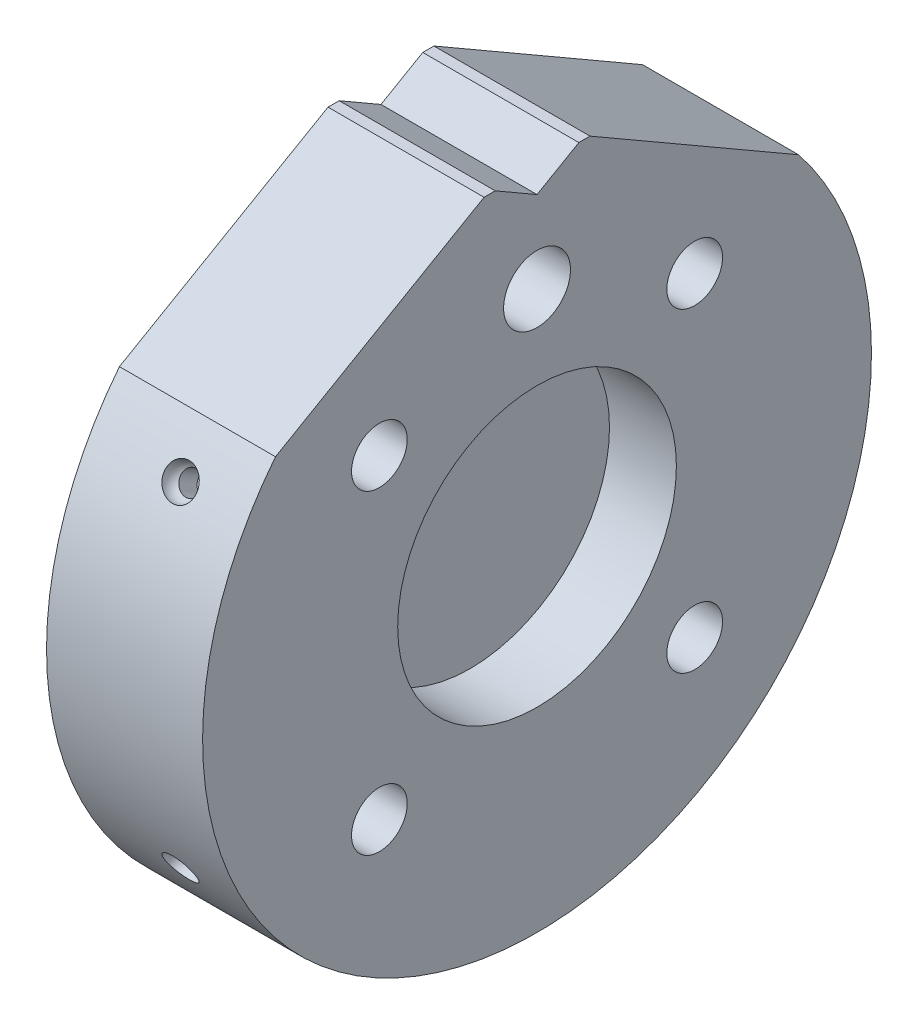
ISO-10303-21;
HEADER;
FILE_DESCRIPTION(('STEP AP214'),'2;1');
FILE_NAME('part.step','',(''),(''),'','','');
FILE_SCHEMA(('AUTOMOTIVE_DESIGN { 1 0 10303 214 1 1 1 1 }'));
ENDSEC;
DATA;
#1=APPLICATION_CONTEXT('core data for automotive mechanical design processes');
#2=APPLICATION_PROTOCOL_DEFINITION('international standard','automotive_design',2000,#1);
#3=PRODUCT_CONTEXT('',#1,'mechanical');
#4=PRODUCT('Part','Part','',(#3));
#5=PRODUCT_RELATED_PRODUCT_CATEGORY('part','',(#4));
#6=PRODUCT_DEFINITION_FORMATION('','',#4);
#7=PRODUCT_DEFINITION_CONTEXT('part definition',#1,'design');
#8=PRODUCT_DEFINITION('design','',#6,#7);
#9=PRODUCT_DEFINITION_SHAPE('','',#8);
#10=(LENGTH_UNIT() NAMED_UNIT(*) SI_UNIT(.MILLI.,.METRE.));
#11=(NAMED_UNIT(*) PLANE_ANGLE_UNIT() SI_UNIT($,.RADIAN.));
#12=(NAMED_UNIT(*) SI_UNIT($,.STERADIAN.) SOLID_ANGLE_UNIT());
#13=UNCERTAINTY_MEASURE_WITH_UNIT(LENGTH_MEASURE(1.E-05),#10,'distance_accuracy_value','');
#14=(GEOMETRIC_REPRESENTATION_CONTEXT(3) GLOBAL_UNCERTAINTY_ASSIGNED_CONTEXT((#13)) GLOBAL_UNIT_ASSIGNED_CONTEXT((#10,
#11,#12)) REPRESENTATION_CONTEXT('',''));
#15=CARTESIAN_POINT('',(0.,0.,0.));
#16=DIRECTION('',(0.,0.,1.));
#17=DIRECTION('',(1.,0.,0.));
#18=AXIS2_PLACEMENT_3D('',#15,#16,#17);
#19=CARTESIAN_POINT('',(63.0638210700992,0.,0.));
#20=DIRECTION('',(1.,0.,0.));
#21=DIRECTION('',(0.,0.,-1.));
#22=AXIS2_PLACEMENT_3D('',#19,#20,#21);
#23=CYLINDRICAL_SURFACE('',#22,30.);
#24=CARTESIAN_POINT('',(-5.99999999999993,-16.2798820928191,-25.1985205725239));
#25=CARTESIAN_POINT('',(-6.08424267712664,-16.2798791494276,-25.1985228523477));
#26=CARTESIAN_POINT('',(-6.1685450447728,-16.2739007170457,-25.2023880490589));
#27=CARTESIAN_POINT('',(-6.33482591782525,-16.250119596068,-25.2177280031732));
#28=CARTESIAN_POINT('',(-6.41680156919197,-16.2323029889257,-25.2292117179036));
#29=CARTESIAN_POINT('',(-6.57599789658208,-16.1853070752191,-25.2593865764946));
#30=CARTESIAN_POINT('',(-6.65322081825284,-16.1561331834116,-25.2780742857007));
#31=CARTESIAN_POINT('',(-6.80073472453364,-16.0871874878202,-25.3220074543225));
#32=CARTESIAN_POINT('',(-6.87102737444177,-16.0474182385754,-25.3472513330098));
#33=CARTESIAN_POINT('',(-7.00272927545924,-15.9583082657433,-25.4034478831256));
#34=CARTESIAN_POINT('',(-7.06413623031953,-15.9089650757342,-25.4344020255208));
#35=CARTESIAN_POINT('',(-7.17630490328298,-15.8020181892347,-25.5009839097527));
#36=CARTESIAN_POINT('',(-7.22706621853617,-15.7444141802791,-25.5366118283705));
#37=CARTESIAN_POINT('',(-7.31649530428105,-15.6224998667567,-25.6113764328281));
#38=CARTESIAN_POINT('',(-7.35516446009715,-15.5581903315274,-25.6505127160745));
#39=CARTESIAN_POINT('',(-7.41931882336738,-15.4246111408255,-25.7310599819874));
#40=CARTESIAN_POINT('',(-7.44480410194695,-15.3553415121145,-25.7724709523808));
#41=CARTESIAN_POINT('',(-7.48185548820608,-15.2138008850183,-25.8562762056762));
#42=CARTESIAN_POINT('',(-7.49342990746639,-15.1415317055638,-25.8986698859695));
#43=CARTESIAN_POINT('',(-7.50235845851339,-14.9959821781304,-25.9832176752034));
#44=CARTESIAN_POINT('',(-7.49971266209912,-14.9227018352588,-26.0253717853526));
#45=CARTESIAN_POINT('',(-7.48028080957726,-14.7772526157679,-26.1082325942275));
#46=CARTESIAN_POINT('',(-7.46350149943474,-14.7050832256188,-26.1489399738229));
#47=CARTESIAN_POINT('',(-7.41628768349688,-14.5639025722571,-26.2278341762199));
#48=CARTESIAN_POINT('',(-7.3858531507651,-14.4948913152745,-26.2660209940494));
#49=CARTESIAN_POINT('',(-7.31218313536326,-14.36202756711,-26.3389049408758));
#50=CARTESIAN_POINT('',(-7.26894465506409,-14.2981762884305,-26.3736012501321));
#51=CARTESIAN_POINT('',(-7.1708946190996,-14.1775370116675,-26.4386487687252));
#52=CARTESIAN_POINT('',(-7.11608302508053,-14.1207490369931,-26.4689999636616));
#53=CARTESIAN_POINT('',(-6.99639965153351,-14.0158965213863,-26.5246711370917));
#54=CARTESIAN_POINT('',(-6.93152134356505,-13.9678376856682,-26.5499878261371));
#55=CARTESIAN_POINT('',(-6.79356936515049,-13.8819370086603,-26.5950029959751));
#56=CARTESIAN_POINT('',(-6.72049567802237,-13.844095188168,-26.6147014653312));
#57=CARTESIAN_POINT('',(-6.56820038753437,-13.7797667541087,-26.6480646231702));
#58=CARTESIAN_POINT('',(-6.48897684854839,-13.7532837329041,-26.6617274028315));
#59=CARTESIAN_POINT('',(-6.32665077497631,-13.7124990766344,-26.6827266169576));
#60=CARTESIAN_POINT('',(-6.24354824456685,-13.6981974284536,-26.6900630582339));
#61=CARTESIAN_POINT('',(-6.07583843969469,-13.6822151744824,-26.6982596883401));
#62=CARTESIAN_POINT('',(-5.99123142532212,-13.6805324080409,-26.6991209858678));
#63=CARTESIAN_POINT('',(-5.82290125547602,-13.6898338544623,-26.6943528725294));
#64=CARTESIAN_POINT('',(-5.73917809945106,-13.700818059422,-26.688723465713));
#65=CARTESIAN_POINT('',(-5.57500257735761,-13.7351145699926,-26.6710891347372));
#66=CARTESIAN_POINT('',(-5.49454981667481,-13.7584253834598,-26.6590849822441));
#67=CARTESIAN_POINT('',(-5.3391866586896,-13.8166619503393,-26.6289489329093));
#68=CARTESIAN_POINT('',(-5.26427626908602,-13.8515877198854,-26.6108170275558));
#69=CARTESIAN_POINT('',(-5.12210780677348,-13.9320005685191,-26.5688052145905));
#70=CARTESIAN_POINT('',(-5.05485125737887,-13.9774897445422,-26.5449241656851));
#71=CARTESIAN_POINT('',(-4.92991478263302,-14.0776517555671,-26.4919407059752));
#72=CARTESIAN_POINT('',(-4.87223486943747,-14.1323246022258,-26.4628382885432));
#73=CARTESIAN_POINT('',(-4.76808428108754,-14.2492198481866,-26.400078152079));
#74=CARTESIAN_POINT('',(-4.72161432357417,-14.3114427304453,-26.3664201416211));
#75=CARTESIAN_POINT('',(-4.64120762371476,-14.4415881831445,-26.2953611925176));
#76=CARTESIAN_POINT('',(-4.60727083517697,-14.5095107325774,-26.2579602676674));
#77=CARTESIAN_POINT('',(-4.55290749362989,-14.6490273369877,-26.1803812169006));
#78=CARTESIAN_POINT('',(-4.53247450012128,-14.7206196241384,-26.1402044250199));
#79=CARTESIAN_POINT('',(-4.50567342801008,-14.8654296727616,-26.0581258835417));
#80=CARTESIAN_POINT('',(-4.49930531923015,-14.9386474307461,-26.0162241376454));
#81=CARTESIAN_POINT('',(-4.50081449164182,-15.0845689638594,-25.9318891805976));
#82=CARTESIAN_POINT('',(-4.50868311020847,-15.1572730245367,-25.8894563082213));
#83=CARTESIAN_POINT('',(-4.53842541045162,-15.3001649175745,-25.805267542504));
#84=CARTESIAN_POINT('',(-4.56029911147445,-15.3703527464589,-25.7635116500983));
#85=CARTESIAN_POINT('',(-4.61743121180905,-15.5062667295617,-25.681938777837));
#86=CARTESIAN_POINT('',(-4.65268977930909,-15.5719928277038,-25.6421218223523));
#87=CARTESIAN_POINT('',(-4.73559072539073,-15.6971863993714,-25.5656747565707));
#88=CARTESIAN_POINT('',(-4.78323267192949,-15.7566540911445,-25.5290445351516));
#89=CARTESIAN_POINT('',(-4.88957772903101,-15.8677629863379,-25.4601331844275));
#90=CARTESIAN_POINT('',(-4.94828634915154,-15.9194002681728,-25.427854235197));
#91=CARTESIAN_POINT('',(-5.07510440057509,-16.0134542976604,-25.3687283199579));
#92=CARTESIAN_POINT('',(-5.14321613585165,-16.0558687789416,-25.3418826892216));
#93=CARTESIAN_POINT('',(-5.28695714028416,-16.1303826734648,-25.2945194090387));
#94=CARTESIAN_POINT('',(-5.36259349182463,-16.1624722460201,-25.2740077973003));
#95=CARTESIAN_POINT('',(-5.51912883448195,-16.2154174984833,-25.2400719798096));
#96=CARTESIAN_POINT('',(-5.60002152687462,-16.2362863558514,-25.2266394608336));
#97=CARTESIAN_POINT('',(-5.7345114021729,-16.2607928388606,-25.2108455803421));
#98=CARTESIAN_POINT('',(-5.78724067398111,-16.2679429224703,-25.2062306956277));
#99=CARTESIAN_POINT('',(-5.8933053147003,-16.2774884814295,-25.2000674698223));
#100=CARTESIAN_POINT('',(-5.9466406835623,-16.2798839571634,-25.1985191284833));
#101=CARTESIAN_POINT('',(-5.99999999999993,-16.2798820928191,-25.1985205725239));
#102=B_SPLINE_CURVE_WITH_KNOTS('',3,(#24,#25,#26,#27,#28,#29,#30,#31,#32,#33,#34,#35,#36,#37,
#38,#39,#40,#41,#42,#43,#44,#45,#46,#47,#48,#49,#50,#51,#52,#53,#54,#55,#56,#57,#58,#59,#60,#61,
#62,#63,#64,#65,#66,#67,#68,#69,#70,#71,#72,#73,#74,#75,#76,#77,#78,#79,#80,#81,#82,#83,#84,#85,
#86,#87,#88,#89,#90,#91,#92,#93,#94,#95,#96,#97,#98,#99,#100,#101),.UNSPECIFIED.,.T.,.F.,(4,2,2,
2,2,2,2,2,2,2,2,2,2,2,2,2,2,2,2,2,2,2,2,2,2,2,2,2,2,2,2,2,2,2,2,2,2,2,4),(0.,0.252533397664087,
0.505364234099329,0.758074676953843,1.01072424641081,1.26343898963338,1.51616329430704,
1.76885863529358,2.02155261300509,2.27409553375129,2.52663717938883,2.77905835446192,
3.03148002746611,3.28396084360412,3.53644249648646,3.78908857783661,4.0417351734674,
4.29446161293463,4.54718778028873,4.79987067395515,5.05255340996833,5.30520556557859,
5.55785807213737,5.81056077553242,6.06326379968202,6.31598299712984,6.5687012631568,
6.82129891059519,7.07389601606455,7.32633947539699,7.5787832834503,7.83123026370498,
8.08366843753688,8.33623262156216,8.58885879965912,8.8417250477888,9.09429368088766,
9.2542483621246,9.4142030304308),.UNSPECIFIED.);
#103=CARTESIAN_POINT('',(-5.99999999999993,-16.2798820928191,-25.1985205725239));
#104=VERTEX_POINT('',#103);
#105=EDGE_CURVE('E29',#104,#104,#102,.T.);
#106=ORIENTED_EDGE('',*,*,#105,.F.);
#107=EDGE_LOOP('',(#106));
#108=FACE_BOUND('',#107,.T.);
#109=CARTESIAN_POINT('',(-5.99999999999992,16.2798820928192,25.1985205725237));
#110=CARTESIAN_POINT('',(-6.08424267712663,16.2798791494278,25.1985228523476));
#111=CARTESIAN_POINT('',(-6.16854504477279,16.2739007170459,25.2023880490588));
#112=CARTESIAN_POINT('',(-6.33482591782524,16.2501195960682,25.2177280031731));
#113=CARTESIAN_POINT('',(-6.41680156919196,16.2323029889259,25.2292117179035));
#114=CARTESIAN_POINT('',(-6.57599789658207,16.1853070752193,25.2593865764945));
#115=CARTESIAN_POINT('',(-6.65322081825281,16.1561331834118,25.2780742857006));
#116=CARTESIAN_POINT('',(-6.80073472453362,16.0871874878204,25.3220074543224));
#117=CARTESIAN_POINT('',(-6.87102737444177,16.0474182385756,25.3472513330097));
#118=CARTESIAN_POINT('',(-7.00272927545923,15.9583082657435,25.4034478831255));
#119=CARTESIAN_POINT('',(-7.06413623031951,15.9089650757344,25.4344020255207));
#120=CARTESIAN_POINT('',(-7.17630490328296,15.8020181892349,25.5009839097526));
#121=CARTESIAN_POINT('',(-7.22706621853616,15.7444141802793,25.5366118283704));
#122=CARTESIAN_POINT('',(-7.31649530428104,15.6224998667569,25.611376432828));
#123=CARTESIAN_POINT('',(-7.35516446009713,15.5581903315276,25.6505127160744));
#124=CARTESIAN_POINT('',(-7.41931882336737,15.4246111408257,25.7310599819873));
#125=CARTESIAN_POINT('',(-7.44480410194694,15.3553415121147,25.7724709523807));
#126=CARTESIAN_POINT('',(-7.48185548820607,15.2138008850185,25.8562762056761));
#127=CARTESIAN_POINT('',(-7.49342990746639,15.141531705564,25.8986698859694));
#128=CARTESIAN_POINT('',(-7.50235845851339,14.9959821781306,25.9832176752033));
#129=CARTESIAN_POINT('',(-7.49971266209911,14.922701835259,26.0253717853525));
#130=CARTESIAN_POINT('',(-7.48028080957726,14.7772526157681,26.1082325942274));
#131=CARTESIAN_POINT('',(-7.46350149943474,14.705083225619,26.1489399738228));
#132=CARTESIAN_POINT('',(-7.41628768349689,14.5639025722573,26.2278341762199));
#133=CARTESIAN_POINT('',(-7.3858531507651,14.4948913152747,26.2660209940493));
#134=CARTESIAN_POINT('',(-7.31218313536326,14.3620275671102,26.3389049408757));
#135=CARTESIAN_POINT('',(-7.2689446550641,14.2981762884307,26.373601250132));
#136=CARTESIAN_POINT('',(-7.17089461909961,14.1775370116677,26.4386487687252));
#137=CARTESIAN_POINT('',(-7.11608302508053,14.1207490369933,26.4689999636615));
#138=CARTESIAN_POINT('',(-6.9963996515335,14.0158965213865,26.5246711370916));
#139=CARTESIAN_POINT('',(-6.93152134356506,13.9678376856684,26.5499878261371));
#140=CARTESIAN_POINT('',(-6.7935693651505,13.8819370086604,26.595002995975));
#141=CARTESIAN_POINT('',(-6.72049567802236,13.8440951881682,26.6147014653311));
#142=CARTESIAN_POINT('',(-6.56820038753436,13.7797667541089,26.6480646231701));
#143=CARTESIAN_POINT('',(-6.48897684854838,13.7532837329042,26.6617274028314));
#144=CARTESIAN_POINT('',(-6.32665077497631,13.7124990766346,26.6827266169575));
#145=CARTESIAN_POINT('',(-6.24354824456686,13.6981974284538,26.6900630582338));
#146=CARTESIAN_POINT('',(-6.07583843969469,13.6822151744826,26.69825968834));
#147=CARTESIAN_POINT('',(-5.99123142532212,13.6805324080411,26.6991209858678));
#148=CARTESIAN_POINT('',(-5.82290125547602,13.6898338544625,26.6943528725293));
#149=CARTESIAN_POINT('',(-5.73917809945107,13.7008180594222,26.6887234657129));
#150=CARTESIAN_POINT('',(-5.57500257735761,13.7351145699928,26.6710891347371));
#151=CARTESIAN_POINT('',(-5.4945498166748,13.75842538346,26.659084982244));
#152=CARTESIAN_POINT('',(-5.3391866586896,13.8166619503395,26.6289489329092));
#153=CARTESIAN_POINT('',(-5.26427626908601,13.8515877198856,26.6108170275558));
#154=CARTESIAN_POINT('',(-5.12210780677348,13.9320005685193,26.5688052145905));
#155=CARTESIAN_POINT('',(-5.05485125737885,13.9774897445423,26.544924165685));
#156=CARTESIAN_POINT('',(-4.92991478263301,14.0776517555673,26.4919407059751));
#157=CARTESIAN_POINT('',(-4.87223486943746,14.132324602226,26.4628382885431));
#158=CARTESIAN_POINT('',(-4.76808428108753,14.2492198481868,26.4000781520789));
#159=CARTESIAN_POINT('',(-4.72161432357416,14.3114427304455,26.366420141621));
#160=CARTESIAN_POINT('',(-4.64120762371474,14.4415881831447,26.2953611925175));
#161=CARTESIAN_POINT('',(-4.60727083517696,14.5095107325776,26.2579602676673));
#162=CARTESIAN_POINT('',(-4.55290749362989,14.6490273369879,26.1803812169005));
#163=CARTESIAN_POINT('',(-4.53247450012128,14.7206196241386,26.1402044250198));
#164=CARTESIAN_POINT('',(-4.50567342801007,14.8654296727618,26.0581258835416));
#165=CARTESIAN_POINT('',(-4.49930531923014,14.9386474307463,26.0162241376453));
#166=CARTESIAN_POINT('',(-4.50081449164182,15.0845689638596,25.9318891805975));
#167=CARTESIAN_POINT('',(-4.50868311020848,15.1572730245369,25.8894563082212));
#168=CARTESIAN_POINT('',(-4.53842541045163,15.3001649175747,25.8052675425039));
#169=CARTESIAN_POINT('',(-4.56029911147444,15.3703527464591,25.7635116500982));
#170=CARTESIAN_POINT('',(-4.61743121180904,15.5062667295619,25.6819387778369));
#171=CARTESIAN_POINT('',(-4.6526897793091,15.571992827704,25.6421218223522));
#172=CARTESIAN_POINT('',(-4.73559072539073,15.6971863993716,25.5656747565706));
#173=CARTESIAN_POINT('',(-4.78323267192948,15.7566540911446,25.5290445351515));
#174=CARTESIAN_POINT('',(-4.889577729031,15.8677629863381,25.4601331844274));
#175=CARTESIAN_POINT('',(-4.94828634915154,15.919400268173,25.4278542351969));
#176=CARTESIAN_POINT('',(-5.07510440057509,16.0134542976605,25.3687283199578));
#177=CARTESIAN_POINT('',(-5.14321613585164,16.0558687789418,25.3418826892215));
#178=CARTESIAN_POINT('',(-5.28695714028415,16.130382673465,25.2945194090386));
#179=CARTESIAN_POINT('',(-5.36259349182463,16.1624722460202,25.2740077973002));
#180=CARTESIAN_POINT('',(-5.51912883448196,16.2154174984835,25.2400719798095));
#181=CARTESIAN_POINT('',(-5.60002152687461,16.2362863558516,25.2266394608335));
#182=CARTESIAN_POINT('',(-5.73451140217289,16.2607928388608,25.210845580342));
#183=CARTESIAN_POINT('',(-5.7872406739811,16.2679429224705,25.2062306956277));
#184=CARTESIAN_POINT('',(-5.89330531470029,16.2774884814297,25.2000674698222));
#185=CARTESIAN_POINT('',(-5.94664068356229,16.2798839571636,25.1985191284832));
#186=CARTESIAN_POINT('',(-5.99999999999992,16.2798820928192,25.1985205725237));
#187=B_SPLINE_CURVE_WITH_KNOTS('',3,(#109,#110,#111,#112,#113,#114,#115,#116,#117,#118,#119,
#120,#121,#122,#123,#124,#125,#126,#127,#128,#129,#130,#131,#132,#133,#134,#135,#136,#137,#138,
#139,#140,#141,#142,#143,#144,#145,#146,#147,#148,#149,#150,#151,#152,#153,#154,#155,#156,#157,
#158,#159,#160,#161,#162,#163,#164,#165,#166,#167,#168,#169,#170,#171,#172,#173,#174,#175,#176,
#177,#178,#179,#180,#181,#182,#183,#184,#185,#186),.UNSPECIFIED.,.T.,.F.,(4,2,2,2,2,2,2,2,2,2,2,
2,2,2,2,2,2,2,2,2,2,2,2,2,2,2,2,2,2,2,2,2,2,2,2,2,2,2,4),(0.,0.252533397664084,
0.505364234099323,0.758074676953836,1.0107242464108,1.26343898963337,1.51616329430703,
1.76885863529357,2.02155261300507,2.27409553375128,2.52663717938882,2.77905835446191,
3.0314800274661,3.28396084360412,3.53644249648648,3.78908857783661,4.04173517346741,
4.29446161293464,4.54718778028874,4.79987067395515,5.05255340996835,5.3052055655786,
5.55785807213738,5.81056077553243,6.06326379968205,6.31598299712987,6.56870126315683,
6.82129891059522,7.07389601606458,7.32633947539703,7.57878328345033,7.831230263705,
8.08366843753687,8.33623262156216,8.58885879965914,8.84172504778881,9.09429368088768,
9.25424836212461,9.41420303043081),.UNSPECIFIED.);
#188=CARTESIAN_POINT('',(-5.99999999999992,16.2798820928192,25.1985205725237));
#189=VERTEX_POINT('',#188);
#190=EDGE_CURVE('E171',#189,#189,#187,.T.);
#191=ORIENTED_EDGE('',*,*,#190,.F.);
#192=EDGE_LOOP('',(#191));
#193=FACE_BOUND('',#192,.T.);
#194=CARTESIAN_POINT('',(-9.,0.,-30.));
#195=CARTESIAN_POINT('',(-9.00000493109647,0.11220718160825,-29.9999991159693));
#196=CARTESIAN_POINT('',(-9.00947457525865,0.22449254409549,-29.9993637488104));
#197=CARTESIAN_POINT('',(-9.04711431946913,0.445961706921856,-29.99689022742));
#198=CARTESIAN_POINT('',(-9.07530608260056,0.55514176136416,-29.9950506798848));
#199=CARTESIAN_POINT('',(-9.14957575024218,0.767160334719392,-29.9903768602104));
#200=CARTESIAN_POINT('',(-9.19564409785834,0.870002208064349,-29.9875431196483));
#201=CARTESIAN_POINT('',(-9.30434343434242,1.06646693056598,-29.981199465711));
#202=CARTESIAN_POINT('',(-9.36697067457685,1.16009185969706,-29.9776897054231));
#203=CARTESIAN_POINT('',(-9.50712520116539,1.33564919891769,-29.9703817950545));
#204=CARTESIAN_POINT('',(-9.58467450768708,1.41756401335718,-29.9665832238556));
#205=CARTESIAN_POINT('',(-9.75242614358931,1.56722526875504,-29.9591293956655));
#206=CARTESIAN_POINT('',(-9.84262900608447,1.63497111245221,-29.9554741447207));
#207=CARTESIAN_POINT('',(-10.0332285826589,1.75442692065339,-29.9487158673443));
#208=CARTESIAN_POINT('',(-10.1336346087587,1.80612205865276,-29.9456133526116));
#209=CARTESIAN_POINT('',(-10.3417251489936,1.8919141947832,-29.9403159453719));
#210=CARTESIAN_POINT('',(-10.4494095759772,1.92601140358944,-29.9381210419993));
#211=CARTESIAN_POINT('',(-10.6688288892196,1.97559039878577,-29.9348904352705));
#212=CARTESIAN_POINT('',(-10.7805574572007,1.99110003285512,-29.9338529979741));
#213=CARTESIAN_POINT('',(-11.0050365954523,2.00314959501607,-29.9330491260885));
#214=CARTESIAN_POINT('',(-11.117787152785,1.99968976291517,-29.9332826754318));
#215=CARTESIAN_POINT('',(-11.3409197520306,1.97392169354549,-29.9349928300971));
#216=CARTESIAN_POINT('',(-11.4513052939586,1.95164361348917,-29.9364674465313));
#217=CARTESIAN_POINT('',(-11.666766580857,1.8889182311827,-29.940490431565));
#218=CARTESIAN_POINT('',(-11.771842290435,1.84847080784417,-29.9430388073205));
#219=CARTESIAN_POINT('',(-11.9737979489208,1.75052074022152,-29.9489244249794));
#220=CARTESIAN_POINT('',(-12.0706712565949,1.69300444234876,-29.9522622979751));
#221=CARTESIAN_POINT('',(-12.2533996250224,1.56255918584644,-29.9593501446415));
#222=CARTESIAN_POINT('',(-12.3392545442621,1.4896300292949,-29.9631001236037));
#223=CARTESIAN_POINT('',(-12.4976844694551,1.33025952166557,-29.9705984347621));
#224=CARTESIAN_POINT('',(-12.5702332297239,1.24379207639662,-29.9743467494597));
#225=CARTESIAN_POINT('',(-12.6997889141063,1.0598908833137,-29.9814123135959));
#226=CARTESIAN_POINT('',(-12.7567958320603,0.962457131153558,-29.9847295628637));
#227=CARTESIAN_POINT('',(-12.8536474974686,0.759372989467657,-29.9905595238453));
#228=CARTESIAN_POINT('',(-12.8934912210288,0.653722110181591,-29.9930721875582));
#229=CARTESIAN_POINT('',(-12.9548677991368,0.437209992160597,-29.9970092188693));
#230=CARTESIAN_POINT('',(-12.9764008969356,0.326348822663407,-29.9984336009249));
#231=CARTESIAN_POINT('',(-13.0005123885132,0.102790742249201,-30.0000317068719));
#232=CARTESIAN_POINT('',(-13.0031270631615,-0.00990223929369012,-30.0002078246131));
#233=CARTESIAN_POINT('',(-12.9894223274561,-0.234125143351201,-29.9992959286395));
#234=CARTESIAN_POINT('',(-12.9731030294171,-0.34565507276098,-29.9982079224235));
#235=CARTESIAN_POINT('',(-12.9220236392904,-0.564283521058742,-29.9948917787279));
#236=CARTESIAN_POINT('',(-12.8872802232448,-0.671385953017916,-29.9926646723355));
#237=CARTESIAN_POINT('',(-12.8003557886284,-0.878240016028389,-29.987320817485));
#238=CARTESIAN_POINT('',(-12.7481745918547,-0.977991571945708,-29.9842040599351));
#239=CARTESIAN_POINT('',(-12.6277636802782,-1.16747826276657,-29.9774249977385));
#240=CARTESIAN_POINT('',(-12.5595097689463,-1.25719799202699,-29.9737618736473));
#241=CARTESIAN_POINT('',(-12.4089260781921,-1.42391905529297,-29.9663049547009));
#242=CARTESIAN_POINT('',(-12.3265961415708,-1.5009202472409,-29.9625111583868));
#243=CARTESIAN_POINT('',(-12.1500407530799,-1.64014163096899,-29.9552135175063));
#244=CARTESIAN_POINT('',(-12.0557966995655,-1.70233826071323,-29.9517101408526));
#245=CARTESIAN_POINT('',(-11.8581816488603,-1.81002374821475,-29.9453959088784));
#246=CARTESIAN_POINT('',(-11.7548107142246,-1.85551272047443,-29.9425850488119));
#247=CARTESIAN_POINT('',(-11.5419618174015,-1.92845094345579,-29.9379762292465));
#248=CARTESIAN_POINT('',(-11.4324889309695,-1.95591495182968,-29.9361774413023));
#249=CARTESIAN_POINT('',(-11.21047333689,-1.99207181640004,-29.9337933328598));
#250=CARTESIAN_POINT('',(-11.0979306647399,-2.0007648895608,-29.9332079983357));
#251=CARTESIAN_POINT('',(-10.8732044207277,-1.99913096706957,-29.9333171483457));
#252=CARTESIAN_POINT('',(-10.7610205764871,-1.98884100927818,-29.9340091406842));
#253=CARTESIAN_POINT('',(-10.5399774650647,-1.94960998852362,-29.9365896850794));
#254=CARTESIAN_POINT('',(-10.4311182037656,-1.92066889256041,-29.9384782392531));
#255=CARTESIAN_POINT('',(-10.2198094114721,-1.84496567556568,-29.9432384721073));
#256=CARTESIAN_POINT('',(-10.117359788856,-1.79820380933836,-29.946110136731));
#257=CARTESIAN_POINT('',(-9.921760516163,-1.68819129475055,-29.952512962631));
#258=CARTESIAN_POINT('',(-9.8286106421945,-1.62494104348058,-29.9560441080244));
#259=CARTESIAN_POINT('',(-9.65406672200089,-1.48360954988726,-29.9633760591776));
#260=CARTESIAN_POINT('',(-9.5726945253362,-1.405501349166,-29.9671773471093));
#261=CARTESIAN_POINT('',(-9.42418798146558,-1.23671085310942,-29.9746170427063));
#262=CARTESIAN_POINT('',(-9.35705711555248,-1.14602549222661,-29.9782554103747));
#263=CARTESIAN_POINT('',(-9.23888236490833,-0.954539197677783,-29.9849635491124));
#264=CARTESIAN_POINT('',(-9.1878602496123,-0.853724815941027,-29.988032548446));
#265=CARTESIAN_POINT('',(-9.10352994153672,-0.645012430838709,-29.9932460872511));
#266=CARTESIAN_POINT('',(-9.07020107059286,-0.537122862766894,-29.9953917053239));
#267=CARTESIAN_POINT('',(-9.0308350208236,-0.357147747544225,-29.9979564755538));
#268=CARTESIAN_POINT('',(-9.01928691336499,-0.286224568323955,-29.9987193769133));
#269=CARTESIAN_POINT('',(-9.00386783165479,-0.143544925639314,-29.9997414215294));
#270=CARTESIAN_POINT('',(-8.9999968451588,-0.071788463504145,-30.0000005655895));
#271=CARTESIAN_POINT('',(-9.,0.,-30.));
#272=B_SPLINE_CURVE_WITH_KNOTS('',3,(#194,#195,#196,#197,#198,#199,#200,#201,#202,#203,#204,
#205,#206,#207,#208,#209,#210,#211,#212,#213,#214,#215,#216,#217,#218,#219,#220,#221,#222,#223,
#224,#225,#226,#227,#228,#229,#230,#231,#232,#233,#234,#235,#236,#237,#238,#239,#240,#241,#242,
#243,#244,#245,#246,#247,#248,#249,#250,#251,#252,#253,#254,#255,#256,#257,#258,#259,#260,#261,
#262,#263,#264,#265,#266,#267,#268,#269,#270,#271),.UNSPECIFIED.,.T.,.F.,(4,2,2,2,2,2,2,2,2,2,2,
2,2,2,2,2,2,2,2,2,2,2,2,2,2,2,2,2,2,2,2,2,2,2,2,2,2,2,4),(0.,0.336359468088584,
0.673108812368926,1.0096783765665,1.34617181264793,1.68316566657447,2.02017372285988,
2.35749216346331,2.69480656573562,3.03161497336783,3.36841912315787,3.70468454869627,
4.04095221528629,4.37748959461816,4.71403129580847,5.05122983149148,5.3884285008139,
5.72564728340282,6.06286158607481,6.39942902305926,6.73599446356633,7.07225579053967,
7.40852055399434,7.74529481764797,8.08207284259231,8.41938333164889,8.75669150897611,
9.09372317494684,9.43075094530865,9.76712183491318,10.1034933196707,10.4398599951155,
10.7762185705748,11.1131933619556,11.4502504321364,11.7877610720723,12.1248763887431,
12.3400744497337,12.5552721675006),.UNSPECIFIED.);
#273=CARTESIAN_POINT('',(-11.,-2.,-29.9332590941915));
#274=VERTEX_POINT('',#273);
#275=CARTESIAN_POINT('',(-11.,2.,-29.9332590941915));
#276=VERTEX_POINT('',#275);
#277=EDGE_CURVE('E164',#274,#276,#272,.T.);
#278=ORIENTED_EDGE('',*,*,#277,.T.);
#279=DIRECTION('',(1.,0.,0.));
#280=VECTOR('',#279,1.);
#281=CARTESIAN_POINT('',(63.0638210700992,2.,-29.9332590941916));
#282=LINE('',#281,#280);
#283=CARTESIAN_POINT('',(-14.,2.,-29.9332590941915));
#284=VERTEX_POINT('',#283);
#285=EDGE_CURVE('E387',#276,#284,#282,.F.);
#286=ORIENTED_EDGE('',*,*,#285,.T.);
#287=CARTESIAN_POINT('',(-14.,0.,0.));
#288=DIRECTION('',(1.,0.,0.));
#289=DIRECTION('',(0.,0.,-1.));
#290=AXIS2_PLACEMENT_3D('',#287,#288,#289);
#291=CIRCLE('',#290,30.);
#292=CARTESIAN_POINT('',(-14.,18.6972851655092,-23.4608509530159));
#293=VERTEX_POINT('',#292);
#294=EDGE_CURVE('E309',#284,#293,#291,.T.);
#295=ORIENTED_EDGE('',*,*,#294,.T.);
#296=DIRECTION('',(1.,0.,0.));
#297=VECTOR('',#296,1.);
#298=CARTESIAN_POINT('',(-19.,18.6972851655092,-23.4608509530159));
#299=LINE('',#298,#297);
#300=CARTESIAN_POINT('',(0.,18.6972851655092,-23.4608509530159));
#301=VERTEX_POINT('',#300);
#302=EDGE_CURVE('E412',#293,#301,#299,.T.);
#303=ORIENTED_EDGE('',*,*,#302,.T.);
#304=CARTESIAN_POINT('',(0.,0.,0.));
#305=DIRECTION('',(1.,0.,0.));
#306=DIRECTION('',(0.,0.,-1.));
#307=AXIS2_PLACEMENT_3D('',#304,#305,#306);
#308=CIRCLE('',#307,30.);
#309=CARTESIAN_POINT('',(0.,18.6972851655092,23.460850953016));
#310=VERTEX_POINT('',#309);
#311=EDGE_CURVE('E319',#310,#301,#308,.T.);
#312=ORIENTED_EDGE('',*,*,#311,.F.);
#313=DIRECTION('',(1.,0.,0.));
#314=VECTOR('',#313,1.);
#315=CARTESIAN_POINT('',(-19.,18.6972851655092,23.460850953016));
#316=LINE('',#315,#314);
#317=CARTESIAN_POINT('',(-14.,18.6972851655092,23.460850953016));
#318=VERTEX_POINT('',#317);
#319=EDGE_CURVE('E410',#318,#310,#316,.T.);
#320=ORIENTED_EDGE('',*,*,#319,.F.);
#321=CARTESIAN_POINT('',(-14.,-2.,-29.9332590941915));
#322=VERTEX_POINT('',#321);
#323=EDGE_CURVE('E316',#318,#322,#291,.T.);
#324=ORIENTED_EDGE('',*,*,#323,.T.);
#325=DIRECTION('',(1.,0.,0.));
#326=VECTOR('',#325,1.);
#327=CARTESIAN_POINT('',(63.0638210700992,-2.,-29.9332590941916));
#328=LINE('',#327,#326);
#329=EDGE_CURVE('E390',#322,#274,#328,.T.);
#330=ORIENTED_EDGE('',*,*,#329,.T.);
#331=EDGE_LOOP('',(#278,#286,#295,#303,#312,#320,#324,#330));
#332=FACE_BOUND('',#331,.T.);
#333=CARTESIAN_POINT('',(-7.,-29.3938769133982,-6.));
#334=CARTESIAN_POINT('',(-6.83325086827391,-29.393875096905,-6.00000333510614));
#335=CARTESIAN_POINT('',(-6.66654337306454,-29.3952984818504,-5.99304686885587));
#336=CARTESIAN_POINT('',(-6.33428361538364,-29.4009458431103,-5.96528300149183));
#337=CARTESIAN_POINT('',(-6.16873155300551,-29.40517029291,-5.94447325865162));
#338=CARTESIAN_POINT('',(-5.83994304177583,-29.4163000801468,-5.88914931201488));
#339=CARTESIAN_POINT('',(-5.67670784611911,-29.4232068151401,-5.85462796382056));
#340=CARTESIAN_POINT('',(-5.35373328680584,-29.4395002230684,-5.7721394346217));
#341=CARTESIAN_POINT('',(-5.19399523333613,-29.4488878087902,-5.72416730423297));
#342=CARTESIAN_POINT('',(-4.87941263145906,-29.4698539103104,-5.61522748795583));
#343=CARTESIAN_POINT('',(-4.72456163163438,-29.4814293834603,-5.55427783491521));
#344=CARTESIAN_POINT('',(-4.42052435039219,-29.5064523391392,-5.41977382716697));
#345=CARTESIAN_POINT('',(-4.27134018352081,-29.5199005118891,-5.34621482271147));
#346=CARTESIAN_POINT('',(-3.97976399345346,-29.54827876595,-5.18707511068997));
#347=CARTESIAN_POINT('',(-3.83736898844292,-29.5632081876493,-5.10149974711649));
#348=CARTESIAN_POINT('',(-3.56019063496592,-29.594143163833,-4.91886856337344));
#349=CARTESIAN_POINT('',(-3.42541015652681,-29.6101491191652,-4.82180845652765));
#350=CARTESIAN_POINT('',(-3.16279285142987,-29.6429919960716,-4.61563131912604));
#351=CARTESIAN_POINT('',(-3.03506205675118,-29.659836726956,-4.50638045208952));
#352=CARTESIAN_POINT('',(-2.78917885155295,-29.6937060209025,-4.27752319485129));
#353=CARTESIAN_POINT('',(-2.67103000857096,-29.7107306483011,-4.15791298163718));
#354=CARTESIAN_POINT('',(-2.44519647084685,-29.7444746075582,-3.9092158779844));
#355=CARTESIAN_POINT('',(-2.33750869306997,-29.761194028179,-3.78013179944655));
#356=CARTESIAN_POINT('',(-2.13326115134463,-29.793874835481,-3.51327430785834));
#357=CARTESIAN_POINT('',(-2.03670550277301,-29.8098359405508,-3.37549771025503));
#358=CARTESIAN_POINT('',(-1.85468887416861,-29.8406787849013,-3.09103878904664));
#359=CARTESIAN_POINT('',(-1.76932753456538,-29.8555503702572,-2.94429156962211));
#360=CARTESIAN_POINT('',(-1.61125829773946,-29.8836491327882,-2.64391411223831));
#361=CARTESIAN_POINT('',(-1.53855514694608,-29.8968756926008,-2.49028131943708));
#362=CARTESIAN_POINT('',(-1.4064231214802,-29.9212946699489,-2.177319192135));
#363=CARTESIAN_POINT('',(-1.34698836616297,-29.9324879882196,-2.01799241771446));
#364=CARTESIAN_POINT('',(-1.2418008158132,-29.9525329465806,-1.6947246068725));
#365=CARTESIAN_POINT('',(-1.19605298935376,-29.9613837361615,-1.5307819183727));
#366=CARTESIAN_POINT('',(-1.08102274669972,-29.9838019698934,-1.03829197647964));
#367=CARTESIAN_POINT('',(-1.03205178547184,-29.9935985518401,-0.704557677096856));
#368=CARTESIAN_POINT('',(-0.990676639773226,-30.001859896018,-0.0336601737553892));
#369=CARTESIAN_POINT('',(-0.998267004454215,-30.0003257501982,0.303502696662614));
#370=CARTESIAN_POINT('',(-1.0691617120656,-29.9862248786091,0.966838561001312));
#371=CARTESIAN_POINT('',(-1.13167110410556,-29.9738155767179,1.29309968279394));
#372=CARTESIAN_POINT('',(-1.30938895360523,-29.9395309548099,1.93039336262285));
#373=CARTESIAN_POINT('',(-1.42459951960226,-29.9176552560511,2.24142531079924));
#374=CARTESIAN_POINT('',(-1.7051805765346,-29.8666376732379,2.84171580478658));
#375=CARTESIAN_POINT('',(-1.87086259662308,-29.837450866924,3.13082478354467));
#376=CARTESIAN_POINT('',(-2.24745437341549,-29.7750281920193,3.67743053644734));
#377=CARTESIAN_POINT('',(-2.4583693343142,-29.7417918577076,3.9349236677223));
#378=CARTESIAN_POINT('',(-2.92380175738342,-29.6742578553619,4.41570851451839));
#379=CARTESIAN_POINT('',(-3.17901512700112,-29.6399517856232,4.63832588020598));
#380=CARTESIAN_POINT('',(-3.7234986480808,-29.5746942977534,5.03771097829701));
#381=CARTESIAN_POINT('',(-4.01276944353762,-29.5437429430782,5.21447784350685));
#382=CARTESIAN_POINT('',(-4.61812499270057,-29.488682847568,5.51737688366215));
#383=CARTESIAN_POINT('',(-4.93426580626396,-29.4645888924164,5.6433998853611));
#384=CARTESIAN_POINT('',(-5.58382794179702,-29.4261885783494,5.84034205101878));
#385=CARTESIAN_POINT('',(-5.91724700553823,-29.4118809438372,5.91126839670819));
#386=CARTESIAN_POINT('',(-6.58578914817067,-29.3949287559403,5.99499603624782));
#387=CARTESIAN_POINT('',(-6.92078544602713,-29.392088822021,6.00877115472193));
#388=CARTESIAN_POINT('',(-7.58828933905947,-29.3978691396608,5.98042576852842));
#389=CARTESIAN_POINT('',(-7.92079707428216,-29.4064887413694,5.93830843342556));
#390=CARTESIAN_POINT('',(-8.57061184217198,-29.4340339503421,5.80021325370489));
#391=CARTESIAN_POINT('',(-8.88803405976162,-29.4528599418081,5.70475574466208));
#392=CARTESIAN_POINT('',(-9.50237967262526,-29.4986093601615,5.46324619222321));
#393=CARTESIAN_POINT('',(-9.79930137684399,-29.52553345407,5.31718998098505));
#394=CARTESIAN_POINT('',(-10.3684786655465,-29.584884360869,4.97642492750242));
#395=CARTESIAN_POINT('',(-10.6403622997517,-29.6173783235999,4.78110674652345));
#396=CARTESIAN_POINT('',(-11.1478498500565,-29.6840234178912,4.34817315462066));
#397=CARTESIAN_POINT('',(-11.3834500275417,-29.7181747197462,4.11055339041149));
#398=CARTESIAN_POINT('',(-11.8153754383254,-29.7849207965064,3.59539469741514));
#399=CARTESIAN_POINT('',(-12.0110422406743,-29.8174836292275,3.3172989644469));
#400=CARTESIAN_POINT('',(-12.3528749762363,-29.8768274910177,2.73160340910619));
#401=CARTESIAN_POINT('',(-12.499042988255,-29.9036087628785,2.42400482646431));
#402=CARTESIAN_POINT('',(-12.7367743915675,-29.9482382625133,1.78983082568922));
#403=CARTESIAN_POINT('',(-12.8286474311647,-29.96613705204,1.46337490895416));
#404=CARTESIAN_POINT('',(-12.9561431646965,-29.9911918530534,0.799081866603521));
#405=CARTESIAN_POINT('',(-12.9917726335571,-29.9983491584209,0.461246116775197));
#406=CARTESIAN_POINT('',(-13.0021604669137,-30.0004347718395,-0.043117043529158));
#407=CARTESIAN_POINT('',(-12.9986507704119,-29.999729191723,-0.209457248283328));
#408=CARTESIAN_POINT('',(-12.9778462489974,-29.9955746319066,-0.541221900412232));
#409=CARTESIAN_POINT('',(-12.9605566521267,-29.9921266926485,-0.706646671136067));
#410=CARTESIAN_POINT('',(-12.9123143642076,-29.982576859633,-1.03545948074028));
#411=CARTESIAN_POINT('',(-12.8813569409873,-29.9764740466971,-1.19884679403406));
#412=CARTESIAN_POINT('',(-12.8060381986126,-29.9617875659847,-1.52232847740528));
#413=CARTESIAN_POINT('',(-12.761681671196,-29.9532047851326,-1.68242400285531));
#414=CARTESIAN_POINT('',(-12.6599993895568,-29.9338121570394,-1.99795666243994));
#415=CARTESIAN_POINT('',(-12.6026989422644,-29.9230066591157,-2.15340222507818));
#416=CARTESIAN_POINT('',(-12.4755304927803,-29.8994570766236,-2.45884588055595));
#417=CARTESIAN_POINT('',(-12.4056669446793,-29.8867136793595,-2.60884588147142));
#418=CARTESIAN_POINT('',(-12.2538320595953,-29.8596244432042,-2.90251338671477));
#419=CARTESIAN_POINT('',(-12.1718557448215,-29.8452779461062,-3.04617825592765));
#420=CARTESIAN_POINT('',(-11.9964227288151,-29.8153781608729,-3.32611433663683));
#421=CARTESIAN_POINT('',(-11.9029699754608,-29.7998252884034,-3.46238806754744));
#422=CARTESIAN_POINT('',(-11.7035646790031,-29.7676616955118,-3.72889132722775));
#423=CARTESIAN_POINT('',(-11.5974312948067,-29.7510377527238,-3.85898398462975));
#424=CARTESIAN_POINT('',(-11.3747063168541,-29.717435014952,-4.10975159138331));
#425=CARTESIAN_POINT('',(-11.258118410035,-29.7004563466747,-4.23042983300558));
#426=CARTESIAN_POINT('',(-11.01516703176,-29.6665989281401,-4.46167854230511));
#427=CARTESIAN_POINT('',(-10.8887977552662,-29.649720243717,-4.57224292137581));
#428=CARTESIAN_POINT('',(-10.6272412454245,-29.6165504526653,-4.78239003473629));
#429=CARTESIAN_POINT('',(-10.4920572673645,-29.6002591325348,-4.88197678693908));
#430=CARTESIAN_POINT('',(-10.2121777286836,-29.5685397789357,-5.07057246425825));
#431=CARTESIAN_POINT('',(-10.0673927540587,-29.5531234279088,-5.15945073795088));
#432=CARTESIAN_POINT('',(-9.77074645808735,-29.5238083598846,-5.32463866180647));
#433=CARTESIAN_POINT('',(-9.61888777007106,-29.5099090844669,-5.40095294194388));
#434=CARTESIAN_POINT('',(-9.30919466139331,-29.4840397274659,-5.54043652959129));
#435=CARTESIAN_POINT('',(-9.15136395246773,-29.4720684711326,-5.6036138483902));
#436=CARTESIAN_POINT('',(-8.83082320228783,-29.4504044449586,-5.71637667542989));
#437=CARTESIAN_POINT('',(-8.668114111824,-29.440711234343,-5.76596481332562));
#438=CARTESIAN_POINT('',(-8.25853877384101,-29.4197929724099,-5.87197100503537));
#439=CARTESIAN_POINT('',(-8.00934645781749,-29.4101281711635,-5.91991604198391));
#440=CARTESIAN_POINT('',(-7.5067372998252,-29.397171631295,-5.98392745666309));
#441=CARTESIAN_POINT('',(-7.25332060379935,-29.3938796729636,-5.9999949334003));
#442=CARTESIAN_POINT('',(-7.,-29.3938769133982,-6.));
#443=B_SPLINE_CURVE_WITH_KNOTS('',3,(#333,#334,#335,#336,#337,#338,#339,#340,#341,#342,#343,
#344,#345,#346,#347,#348,#349,#350,#351,#352,#353,#354,#355,#356,#357,#358,#359,#360,#361,#362,
#363,#364,#365,#366,#367,#368,#369,#370,#371,#372,#373,#374,#375,#376,#377,#378,#379,#380,#381,
#382,#383,#384,#385,#386,#387,#388,#389,#390,#391,#392,#393,#394,#395,#396,#397,#398,#399,#400,
#401,#402,#403,#404,#405,#406,#407,#408,#409,#410,#411,#412,#413,#414,#415,#416,#417,#418,#419,
#420,#421,#422,#423,#424,#425,#426,#427,#428,#429,#430,#431,#432,#433,#434,#435,#436,#437,#438,
#439,#440,#441,#442),.UNSPECIFIED.,.T.,.F.,(4,2,2,2,2,2,2,2,2,2,2,2,2,2,2,2,2,2,2,2,2,2,2,2,2,2,
2,2,2,2,2,2,2,2,2,2,2,2,2,2,2,2,2,2,2,2,2,2,2,2,2,2,2,2,4),(0.,0.500024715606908,
1.00013397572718,1.50050415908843,2.00105870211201,2.50092218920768,3.00097040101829,
3.50079692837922,4.00081060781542,4.50698586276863,5.01334871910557,5.51956188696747,
6.02596159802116,6.53660041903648,7.04743030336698,7.55803333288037,8.06882149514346,
9.0758243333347,10.0827301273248,11.0752967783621,12.0679031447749,13.0667648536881,
14.0657415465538,15.0821302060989,16.0985380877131,17.1171211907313,18.1355715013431,
19.1365948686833,20.1375614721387,21.1289299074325,22.1203800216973,23.1247529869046,
24.1292293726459,25.1491255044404,26.1689787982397,27.1829582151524,28.1968154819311,
28.6954646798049,29.1939247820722,29.6925576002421,30.1910123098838,30.6885007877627,
31.185813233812,31.683330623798,32.1806773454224,32.6862322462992,33.1916095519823,
33.697289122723,34.2027829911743,34.7139260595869,35.2248803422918,35.7355221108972,
36.2460649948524,37.0057147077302,37.7653382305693),.UNSPECIFIED.);
#444=CARTESIAN_POINT('',(-7.,-29.3938769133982,-6.));
#445=VERTEX_POINT('',#444);
#446=EDGE_CURVE('E155',#445,#445,#443,.T.);
#447=ORIENTED_EDGE('',*,*,#446,.F.);
#448=EDGE_LOOP('',(#447));
#449=FACE_BOUND('',#448,.T.);
#450=CARTESIAN_POINT('',(-5.99999999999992,-16.2798820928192,25.1985205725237));
#451=CARTESIAN_POINT('',(-5.91575732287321,-16.2798791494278,25.1985228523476));
#452=CARTESIAN_POINT('',(-5.83145495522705,-16.2739007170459,25.2023880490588));
#453=CARTESIAN_POINT('',(-5.6651740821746,-16.2501195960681,25.2177280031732));
#454=CARTESIAN_POINT('',(-5.58319843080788,-16.2323029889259,25.2292117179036));
#455=CARTESIAN_POINT('',(-5.42400210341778,-16.1853070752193,25.2593865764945));
#456=CARTESIAN_POINT('',(-5.34677918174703,-16.1561331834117,25.2780742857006));
#457=CARTESIAN_POINT('',(-5.19926527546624,-16.0871874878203,25.3220074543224));
#458=CARTESIAN_POINT('',(-5.1289726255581,-16.0474182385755,25.3472513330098));
#459=CARTESIAN_POINT('',(-4.99727072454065,-15.9583082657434,25.4034478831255));
#460=CARTESIAN_POINT('',(-4.93586376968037,-15.9089650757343,25.4344020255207));
#461=CARTESIAN_POINT('',(-4.82369509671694,-15.8020181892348,25.5009839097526));
#462=CARTESIAN_POINT('',(-4.77293378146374,-15.7444141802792,25.5366118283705));
#463=CARTESIAN_POINT('',(-4.68350469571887,-15.6224998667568,25.6113764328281));
#464=CARTESIAN_POINT('',(-4.64483553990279,-15.5581903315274,25.6505127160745));
#465=CARTESIAN_POINT('',(-4.58068117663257,-15.4246111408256,25.7310599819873));
#466=CARTESIAN_POINT('',(-4.555195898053,-15.3553415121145,25.7724709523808));
#467=CARTESIAN_POINT('',(-4.51814451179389,-15.2138008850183,25.8562762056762));
#468=CARTESIAN_POINT('',(-4.5065700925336,-15.1415317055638,25.8986698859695));
#469=CARTESIAN_POINT('',(-4.49764154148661,-14.9959821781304,25.9832176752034));
#470=CARTESIAN_POINT('',(-4.50028733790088,-14.9227018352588,26.0253717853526));
#471=CARTESIAN_POINT('',(-4.51971919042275,-14.7772526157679,26.1082325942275));
#472=CARTESIAN_POINT('',(-4.53649850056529,-14.7050832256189,26.1489399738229));
#473=CARTESIAN_POINT('',(-4.58371231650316,-14.5639025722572,26.2278341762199));
#474=CARTESIAN_POINT('',(-4.61414684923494,-14.4948913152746,26.2660209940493));
#475=CARTESIAN_POINT('',(-4.6878168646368,-14.3620275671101,26.3389049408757));
#476=CARTESIAN_POINT('',(-4.73105534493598,-14.2981762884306,26.3736012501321));
#477=CARTESIAN_POINT('',(-4.82910538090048,-14.1775370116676,26.4386487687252));
#478=CARTESIAN_POINT('',(-4.88391697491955,-14.1207490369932,26.4689999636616));
#479=CARTESIAN_POINT('',(-5.00360034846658,-14.0158965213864,26.5246711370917));
#480=CARTESIAN_POINT('',(-5.06847865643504,-13.9678376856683,26.5499878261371));
#481=CARTESIAN_POINT('',(-5.20643063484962,-13.8819370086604,26.5950029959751));
#482=CARTESIAN_POINT('',(-5.27950432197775,-13.8440951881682,26.6147014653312));
#483=CARTESIAN_POINT('',(-5.43179961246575,-13.7797667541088,26.6480646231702));
#484=CARTESIAN_POINT('',(-5.51102315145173,-13.7532837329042,26.6617274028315));
#485=CARTESIAN_POINT('',(-5.67334922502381,-13.7124990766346,26.6827266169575));
#486=CARTESIAN_POINT('',(-5.75645175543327,-13.6981974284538,26.6900630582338));
#487=CARTESIAN_POINT('',(-5.92416156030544,-13.6822151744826,26.69825968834));
#488=CARTESIAN_POINT('',(-6.00876857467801,-13.6805324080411,26.6991209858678));
#489=CARTESIAN_POINT('',(-6.17709874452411,-13.6898338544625,26.6943528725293));
#490=CARTESIAN_POINT('',(-6.26082190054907,-13.7008180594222,26.6887234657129));
#491=CARTESIAN_POINT('',(-6.42499742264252,-13.7351145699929,26.6710891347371));
#492=CARTESIAN_POINT('',(-6.50545018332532,-13.75842538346,26.659084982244));
#493=CARTESIAN_POINT('',(-6.66081334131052,-13.8166619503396,26.6289489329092));
#494=CARTESIAN_POINT('',(-6.73572373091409,-13.8515877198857,26.6108170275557));
#495=CARTESIAN_POINT('',(-6.87789219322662,-13.9320005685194,26.5688052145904));
#496=CARTESIAN_POINT('',(-6.94514874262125,-13.9774897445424,26.544924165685));
#497=CARTESIAN_POINT('',(-7.07008521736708,-14.0776517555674,26.491940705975));
#498=CARTESIAN_POINT('',(-7.12776513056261,-14.1323246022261,26.4628382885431));
#499=CARTESIAN_POINT('',(-7.23191571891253,-14.2492198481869,26.4000781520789));
#500=CARTESIAN_POINT('',(-7.27838567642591,-14.3114427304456,26.366420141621));
#501=CARTESIAN_POINT('',(-7.35879237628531,-14.4415881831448,26.2953611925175));
#502=CARTESIAN_POINT('',(-7.39272916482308,-14.5095107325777,26.2579602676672));
#503=CARTESIAN_POINT('',(-7.44709250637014,-14.649027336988,26.1803812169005));
#504=CARTESIAN_POINT('',(-7.46752549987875,-14.7206196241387,26.1402044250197));
#505=CARTESIAN_POINT('',(-7.49432657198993,-14.8654296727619,26.0581258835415));
#506=CARTESIAN_POINT('',(-7.50069468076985,-14.9386474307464,26.0162241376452));
#507=CARTESIAN_POINT('',(-7.49918550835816,-15.0845689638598,25.9318891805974));
#508=CARTESIAN_POINT('',(-7.49131688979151,-15.157273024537,25.8894563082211));
#509=CARTESIAN_POINT('',(-7.46157458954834,-15.3001649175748,25.8052675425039));
#510=CARTESIAN_POINT('',(-7.4397008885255,-15.3703527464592,25.7635116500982));
#511=CARTESIAN_POINT('',(-7.38256878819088,-15.506266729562,25.6819387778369));
#512=CARTESIAN_POINT('',(-7.34731022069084,-15.5719928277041,25.6421218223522));
#513=CARTESIAN_POINT('',(-7.2644092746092,-15.6971863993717,25.5656747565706));
#514=CARTESIAN_POINT('',(-7.21676732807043,-15.7566540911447,25.5290445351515));
#515=CARTESIAN_POINT('',(-7.11042227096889,-15.8677629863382,25.4601331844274));
#516=CARTESIAN_POINT('',(-7.05171365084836,-15.9194002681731,25.4278542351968));
#517=CARTESIAN_POINT('',(-6.9248955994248,-16.0134542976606,25.3687283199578));
#518=CARTESIAN_POINT('',(-6.85678386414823,-16.0558687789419,25.3418826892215));
#519=CARTESIAN_POINT('',(-6.71304285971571,-16.1303826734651,25.2945194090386));
#520=CARTESIAN_POINT('',(-6.63740650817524,-16.1624722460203,25.2740077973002));
#521=CARTESIAN_POINT('',(-6.4808711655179,-16.2154174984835,25.2400719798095));
#522=CARTESIAN_POINT('',(-6.39997847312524,-16.2362863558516,25.2266394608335));
#523=CARTESIAN_POINT('',(-6.26548859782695,-16.2607928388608,25.210845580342));
#524=CARTESIAN_POINT('',(-6.21275932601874,-16.2679429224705,25.2062306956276));
#525=CARTESIAN_POINT('',(-6.10669468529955,-16.2774884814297,25.2000674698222));
#526=CARTESIAN_POINT('',(-6.05335931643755,-16.2798839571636,25.1985191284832));
#527=CARTESIAN_POINT('',(-5.99999999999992,-16.2798820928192,25.1985205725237));
#528=B_SPLINE_CURVE_WITH_KNOTS('',3,(#450,#451,#452,#453,#454,#455,#456,#457,#458,#459,#460,
#461,#462,#463,#464,#465,#466,#467,#468,#469,#470,#471,#472,#473,#474,#475,#476,#477,#478,#479,
#480,#481,#482,#483,#484,#485,#486,#487,#488,#489,#490,#491,#492,#493,#494,#495,#496,#497,#498,
#499,#500,#501,#502,#503,#504,#505,#506,#507,#508,#509,#510,#511,#512,#513,#514,#515,#516,#517,
#518,#519,#520,#521,#522,#523,#524,#525,#526,#527),.UNSPECIFIED.,.T.,.F.,(4,2,2,2,2,2,2,2,2,2,2,
2,2,2,2,2,2,2,2,2,2,2,2,2,2,2,2,2,2,2,2,2,2,2,2,2,2,2,4),(0.,0.252533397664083,
0.505364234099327,0.758074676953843,1.01072424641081,1.26343898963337,1.51616329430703,
1.76885863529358,2.0215526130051,2.2740955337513,2.52663717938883,2.7790583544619,
3.03148002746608,3.2839608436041,3.53644249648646,3.78908857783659,4.04173517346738,
4.29446161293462,4.54718778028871,4.79987067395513,5.05255340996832,5.30520556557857,
5.55785807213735,5.81056077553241,6.06326379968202,6.31598299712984,6.56870126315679,
6.82129891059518,7.07389601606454,7.32633947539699,7.57878328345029,7.83123026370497,
8.08366843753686,8.33623262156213,8.58885879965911,8.84172504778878,9.09429368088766,
9.2542483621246,9.41420303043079),.UNSPECIFIED.);
#529=CARTESIAN_POINT('',(-5.99999999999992,-16.2798820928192,25.1985205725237));
#530=VERTEX_POINT('',#529);
#531=EDGE_CURVE('E176',#530,#530,#528,.T.);
#532=ORIENTED_EDGE('',*,*,#531,.F.);
#533=EDGE_LOOP('',(#532));
#534=FACE_BOUND('',#533,.T.);
#535=CARTESIAN_POINT('',(-5.99999999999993,16.2798820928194,-25.1985205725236));
#536=CARTESIAN_POINT('',(-5.91575732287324,16.279879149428,-25.1985228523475));
#537=CARTESIAN_POINT('',(-5.83145495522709,16.2739007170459,-25.2023880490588));
#538=CARTESIAN_POINT('',(-5.66517408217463,16.2501195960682,-25.2177280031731));
#539=CARTESIAN_POINT('',(-5.58319843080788,16.232302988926,-25.2292117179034));
#540=CARTESIAN_POINT('',(-5.42400210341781,16.1853070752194,-25.2593865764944));
#541=CARTESIAN_POINT('',(-5.34677918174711,16.1561331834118,-25.2780742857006));
#542=CARTESIAN_POINT('',(-5.19926527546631,16.0871874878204,-25.3220074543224));
#543=CARTESIAN_POINT('',(-5.12897262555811,16.0474182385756,-25.3472513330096));
#544=CARTESIAN_POINT('',(-4.99727072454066,15.9583082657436,-25.4034478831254));
#545=CARTESIAN_POINT('',(-4.93586376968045,15.9089650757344,-25.4344020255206));
#546=CARTESIAN_POINT('',(-4.82369509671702,15.8020181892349,-25.5009839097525));
#547=CARTESIAN_POINT('',(-4.77293378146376,15.7444141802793,-25.5366118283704));
#548=CARTESIAN_POINT('',(-4.68350469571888,15.622499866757,-25.6113764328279));
#549=CARTESIAN_POINT('',(-4.64483553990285,15.5581903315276,-25.6505127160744));
#550=CARTESIAN_POINT('',(-4.58068117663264,15.4246111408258,-25.7310599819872));
#551=CARTESIAN_POINT('',(-4.55519589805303,15.3553415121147,-25.7724709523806));
#552=CARTESIAN_POINT('',(-4.51814451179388,15.2138008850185,-25.8562762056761));
#553=CARTESIAN_POINT('',(-4.5065700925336,15.141531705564,-25.8986698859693));
#554=CARTESIAN_POINT('',(-4.49764154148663,14.9959821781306,-25.9832176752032));
#555=CARTESIAN_POINT('',(-4.5002873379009,14.922701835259,-26.0253717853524));
#556=CARTESIAN_POINT('',(-4.51971919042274,14.7772526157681,-26.1082325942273));
#557=CARTESIAN_POINT('',(-4.53649850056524,14.705083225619,-26.1489399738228));
#558=CARTESIAN_POINT('',(-4.58371231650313,14.5639025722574,-26.2278341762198));
#559=CARTESIAN_POINT('',(-4.61414684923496,14.4948913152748,-26.2660209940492));
#560=CARTESIAN_POINT('',(-4.6878168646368,14.3620275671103,-26.3389049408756));
#561=CARTESIAN_POINT('',(-4.73105534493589,14.2981762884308,-26.373601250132));
#562=CARTESIAN_POINT('',(-4.8291053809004,14.1775370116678,-26.4386487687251));
#563=CARTESIAN_POINT('',(-4.88391697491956,14.1207490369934,-26.4689999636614));
#564=CARTESIAN_POINT('',(-5.0036003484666,14.0158965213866,-26.5246711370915));
#565=CARTESIAN_POINT('',(-5.06847865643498,13.9678376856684,-26.5499878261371));
#566=CARTESIAN_POINT('',(-5.20643063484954,13.8819370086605,-26.595002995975));
#567=CARTESIAN_POINT('',(-5.27950432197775,13.8440951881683,-26.6147014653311));
#568=CARTESIAN_POINT('',(-5.43179961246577,13.779766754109,-26.6480646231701));
#569=CARTESIAN_POINT('',(-5.5110231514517,13.7532837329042,-26.6617274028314));
#570=CARTESIAN_POINT('',(-5.67334922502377,13.7124990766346,-26.6827266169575));
#571=CARTESIAN_POINT('',(-5.75645175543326,13.698197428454,-26.6900630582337));
#572=CARTESIAN_POINT('',(-5.92416156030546,13.6822151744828,-26.6982596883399));
#573=CARTESIAN_POINT('',(-6.00876857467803,13.6805324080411,-26.6991209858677));
#574=CARTESIAN_POINT('',(-6.17709874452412,13.6898338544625,-26.6943528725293));
#575=CARTESIAN_POINT('',(-6.26082190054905,13.7008180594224,-26.6887234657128));
#576=CARTESIAN_POINT('',(-6.42499742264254,13.735114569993,-26.671089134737));
#577=CARTESIAN_POINT('',(-6.50545018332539,13.7584253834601,-26.6590849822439));
#578=CARTESIAN_POINT('',(-6.66081334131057,13.8166619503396,-26.6289489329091));
#579=CARTESIAN_POINT('',(-6.73572373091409,13.8515877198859,-26.6108170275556));
#580=CARTESIAN_POINT('',(-6.87789219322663,13.9320005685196,-26.5688052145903));
#581=CARTESIAN_POINT('',(-6.94514874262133,13.9774897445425,-26.5449241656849));
#582=CARTESIAN_POINT('',(-7.07008521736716,14.0776517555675,-26.491940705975));
#583=CARTESIAN_POINT('',(-7.12776513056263,14.1323246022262,-26.462838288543));
#584=CARTESIAN_POINT('',(-7.23191571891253,14.2492198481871,-26.4000781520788));
#585=CARTESIAN_POINT('',(-7.27838567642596,14.3114427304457,-26.3664201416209));
#586=CARTESIAN_POINT('',(-7.35879237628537,14.4415881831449,-26.2953611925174));
#587=CARTESIAN_POINT('',(-7.39272916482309,14.5095107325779,-26.2579602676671));
#588=CARTESIAN_POINT('',(-7.44709250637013,14.6490273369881,-26.1803812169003));
#589=CARTESIAN_POINT('',(-7.46752549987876,14.7206196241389,-26.1402044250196));
#590=CARTESIAN_POINT('',(-7.49432657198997,14.865429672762,-26.0581258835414));
#591=CARTESIAN_POINT('',(-7.50069468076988,14.9386474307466,-26.0162241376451));
#592=CARTESIAN_POINT('',(-7.49918550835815,15.0845689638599,-25.9318891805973));
#593=CARTESIAN_POINT('',(-7.49131688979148,15.1572730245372,-25.889456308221));
#594=CARTESIAN_POINT('',(-7.46157458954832,15.300164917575,-25.8052675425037));
#595=CARTESIAN_POINT('',(-7.43970088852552,15.3703527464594,-25.763511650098));
#596=CARTESIAN_POINT('',(-7.38256878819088,15.5062667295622,-25.6819387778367));
#597=CARTESIAN_POINT('',(-7.34731022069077,15.5719928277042,-25.6421218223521));
#598=CARTESIAN_POINT('',(-7.26440927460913,15.6971863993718,-25.5656747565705));
#599=CARTESIAN_POINT('',(-7.21676732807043,15.7566540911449,-25.5290445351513));
#600=CARTESIAN_POINT('',(-7.11042227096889,15.8677629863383,-25.4601331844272));
#601=CARTESIAN_POINT('',(-7.05171365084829,15.9194002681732,-25.4278542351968));
#602=CARTESIAN_POINT('',(-6.92489559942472,16.0134542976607,-25.3687283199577));
#603=CARTESIAN_POINT('',(-6.85678386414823,16.0558687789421,-25.3418826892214));
#604=CARTESIAN_POINT('',(-6.71304285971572,16.1303826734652,-25.2945194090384));
#605=CARTESIAN_POINT('',(-6.63740650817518,16.1624722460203,-25.2740077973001));
#606=CARTESIAN_POINT('',(-6.48087116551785,16.2154174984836,-25.2400719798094));
#607=CARTESIAN_POINT('',(-6.39997847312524,16.2362863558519,-25.2266394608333));
#608=CARTESIAN_POINT('',(-6.26548859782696,16.260792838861,-25.2108455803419));
#609=CARTESIAN_POINT('',(-6.21275932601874,16.2679429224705,-25.2062306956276));
#610=CARTESIAN_POINT('',(-6.10669468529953,16.2774884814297,-25.2000674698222));
#611=CARTESIAN_POINT('',(-6.05335931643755,16.2798839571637,-25.1985191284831));
#612=CARTESIAN_POINT('',(-5.99999999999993,16.2798820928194,-25.1985205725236));
#613=B_SPLINE_CURVE_WITH_KNOTS('',3,(#535,#536,#537,#538,#539,#540,#541,#542,#543,#544,#545,
#546,#547,#548,#549,#550,#551,#552,#553,#554,#555,#556,#557,#558,#559,#560,#561,#562,#563,#564,
#565,#566,#567,#568,#569,#570,#571,#572,#573,#574,#575,#576,#577,#578,#579,#580,#581,#582,#583,
#584,#585,#586,#587,#588,#589,#590,#591,#592,#593,#594,#595,#596,#597,#598,#599,#600,#601,#602,
#603,#604,#605,#606,#607,#608,#609,#610,#611,#612),.UNSPECIFIED.,.T.,.F.,(4,2,2,2,2,2,2,2,2,2,2,
2,2,2,2,2,2,2,2,2,2,2,2,2,2,2,2,2,2,2,2,2,2,2,2,2,2,2,4),(0.,0.252533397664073,
0.505364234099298,0.758074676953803,1.01072424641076,1.26343898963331,1.51616329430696,
1.76885863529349,2.02155261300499,2.2740955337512,2.52663717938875,2.77905835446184,
3.03148002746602,3.28396084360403,3.53644249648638,3.78908857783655,4.04173517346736,
4.2944616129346,4.5471877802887,4.79987067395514,5.05255340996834,5.30520556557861,
5.55785807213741,5.81056077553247,6.06326379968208,6.3159829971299,6.56870126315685,
6.82129891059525,7.07389601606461,7.32633947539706,7.57878328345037,7.83123026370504,
8.08366843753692,8.33623262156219,8.58885879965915,8.84172504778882,9.09429368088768,
9.25424836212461,9.41420303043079),.UNSPECIFIED.);
#614=CARTESIAN_POINT('',(-5.99999999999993,16.2798820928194,-25.1985205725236));
#615=VERTEX_POINT('',#614);
#616=EDGE_CURVE('E11',#615,#615,#613,.T.);
#617=ORIENTED_EDGE('',*,*,#616,.F.);
#618=EDGE_LOOP('',(#617));
#619=FACE_BOUND('',#618,.T.);
#620=ADVANCED_FACE('F17',(#108,#193,#332,#449,#534,#619),#23,.T.);
#621=CARTESIAN_POINT('',(-6.,0.,0.));
#622=DIRECTION('',(-1.,0.,0.));
#623=DIRECTION('',(0.,0.,1.));
#624=AXIS2_PLACEMENT_3D('',#621,#622,#623);
#625=PLANE('',#624);
#626=CARTESIAN_POINT('',(-6.,0.,0.));
#627=DIRECTION('',(1.,0.,0.));
#628=DIRECTION('',(0.,0.,-1.));
#629=AXIS2_PLACEMENT_3D('',#626,#627,#628);
#630=CIRCLE('',#629,12.5);
#631=CARTESIAN_POINT('',(-6.,0.,-12.5));
#632=VERTEX_POINT('',#631);
#633=EDGE_CURVE('E325',#632,#632,#630,.T.);
#634=ORIENTED_EDGE('',*,*,#633,.T.);
#635=EDGE_LOOP('',(#634));
#636=FACE_BOUND('',#635,.T.);
#637=ADVANCED_FACE('F19',(#636),#625,.F.);
#638=CARTESIAN_POINT('',(63.0638210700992,0.,0.));
#639=DIRECTION('',(1.,0.,0.));
#640=DIRECTION('',(0.,0.,-1.));
#641=AXIS2_PLACEMENT_3D('',#638,#639,#640);
#642=CYLINDRICAL_SURFACE('',#641,12.5);
#643=ORIENTED_EDGE('',*,*,#633,.F.);
#644=EDGE_LOOP('',(#643));
#645=FACE_BOUND('',#644,.T.);
#646=CARTESIAN_POINT('',(0.,0.,0.));
#647=DIRECTION('',(1.,0.,0.));
#648=DIRECTION('',(0.,0.,-1.));
#649=AXIS2_PLACEMENT_3D('',#646,#647,#648);
#650=CIRCLE('',#649,12.5);
#651=CARTESIAN_POINT('',(0.,0.,-12.5));
#652=VERTEX_POINT('',#651);
#653=EDGE_CURVE('E322',#652,#652,#650,.T.);
#654=ORIENTED_EDGE('',*,*,#653,.T.);
#655=EDGE_LOOP('',(#654));
#656=FACE_BOUND('',#655,.T.);
#657=ADVANCED_FACE('F142',(#645,#656),#642,.F.);
#658=CARTESIAN_POINT('',(0.,0.,12.5));
#659=DIRECTION('',(-1.,0.,0.));
#660=DIRECTION('',(0.,0.,1.));
#661=AXIS2_PLACEMENT_3D('',#658,#659,#660);
#662=PLANE('',#661);
#663=CARTESIAN_POINT('',(0.,14.1421356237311,14.1421356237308));
#664=DIRECTION('',(1.,0.,0.));
#665=DIRECTION('',(0.,0.,-1.));
#666=AXIS2_PLACEMENT_3D('',#663,#664,#665);
#667=CIRCLE('',#666,2.5);
#668=CARTESIAN_POINT('',(0.,14.1421356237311,11.6421356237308));
#669=VERTEX_POINT('',#668);
#670=EDGE_CURVE('E409',#669,#669,#667,.T.);
#671=ORIENTED_EDGE('',*,*,#670,.F.);
#672=EDGE_LOOP('',(#671));
#673=FACE_BOUND('',#672,.T.);
#674=CARTESIAN_POINT('',(0.,-14.1421356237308,14.1421356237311));
#675=DIRECTION('',(1.,0.,0.));
#676=DIRECTION('',(0.,0.,-1.));
#677=AXIS2_PLACEMENT_3D('',#674,#675,#676);
#678=CIRCLE('',#677,2.5);
#679=CARTESIAN_POINT('',(0.,-14.1421356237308,11.6421356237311));
#680=VERTEX_POINT('',#679);
#681=EDGE_CURVE('E340',#680,#680,#678,.T.);
#682=ORIENTED_EDGE('',*,*,#681,.F.);
#683=EDGE_LOOP('',(#682));
#684=FACE_BOUND('',#683,.T.);
#685=CARTESIAN_POINT('',(0.,-14.142135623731,-14.1421356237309));
#686=DIRECTION('',(1.,0.,0.));
#687=DIRECTION('',(0.,0.,-1.));
#688=AXIS2_PLACEMENT_3D('',#685,#686,#687);
#689=CIRCLE('',#688,2.5);
#690=CARTESIAN_POINT('',(0.,-14.142135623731,-16.6421356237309));
#691=VERTEX_POINT('',#690);
#692=EDGE_CURVE('E336',#691,#691,#689,.T.);
#693=ORIENTED_EDGE('',*,*,#692,.F.);
#694=EDGE_LOOP('',(#693));
#695=FACE_BOUND('',#694,.T.);
#696=CARTESIAN_POINT('',(0.,14.1421356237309,-14.142135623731));
#697=DIRECTION('',(1.,0.,0.));
#698=DIRECTION('',(0.,0.,-1.));
#699=AXIS2_PLACEMENT_3D('',#696,#697,#698);
#700=CIRCLE('',#699,2.5);
#701=CARTESIAN_POINT('',(0.,14.1421356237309,-16.642135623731));
#702=VERTEX_POINT('',#701);
#703=EDGE_CURVE('E332',#702,#702,#700,.T.);
#704=ORIENTED_EDGE('',*,*,#703,.F.);
#705=EDGE_LOOP('',(#704));
#706=FACE_BOUND('',#705,.T.);
#707=CARTESIAN_POINT('',(0.,20.,0.));
#708=DIRECTION('',(1.,0.,0.));
#709=DIRECTION('',(0.,0.,-1.));
#710=AXIS2_PLACEMENT_3D('',#707,#708,#709);
#711=CIRCLE('',#710,3.);
#712=CARTESIAN_POINT('',(0.,20.,-3.));
#713=VERTEX_POINT('',#712);
#714=EDGE_CURVE('E312',#713,#713,#711,.T.);
#715=ORIENTED_EDGE('',*,*,#714,.F.);
#716=EDGE_LOOP('',(#715));
#717=FACE_BOUND('',#716,.T.);
#718=ORIENTED_EDGE('',*,*,#653,.F.);
#719=EDGE_LOOP('',(#718));
#720=FACE_BOUND('',#719,.T.);
#721=DIRECTION('',(0.,0.,-1.));
#722=VECTOR('',#721,1.);
#723=CARTESIAN_POINT('',(0.,29.5,4.75));
#724=LINE('',#723,#722);
#725=CARTESIAN_POINT('',(0.,29.5,4.75));
#726=VERTEX_POINT('',#725);
#727=CARTESIAN_POINT('',(0.,29.5,3.75));
#728=VERTEX_POINT('',#727);
#729=EDGE_CURVE('E381',#726,#728,#724,.T.);
#730=ORIENTED_EDGE('',*,*,#729,.F.);
#731=DIRECTION('',(0.,0.5,-0.866025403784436));
#732=VECTOR('',#731,1.);
#733=CARTESIAN_POINT('',(0.,18.6972851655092,23.460850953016));
#734=LINE('',#733,#732);
#735=EDGE_CURVE('E403',#310,#726,#734,.T.);
#736=ORIENTED_EDGE('',*,*,#735,.F.);
#737=ORIENTED_EDGE('',*,*,#311,.T.);
#738=DIRECTION('',(0.,-0.5,-0.866025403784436));
#739=VECTOR('',#738,1.);
#740=CARTESIAN_POINT('',(0.,29.5,-4.75));
#741=LINE('',#740,#739);
#742=CARTESIAN_POINT('',(0.,29.5,-4.75));
#743=VERTEX_POINT('',#742);
#744=EDGE_CURVE('E401',#743,#301,#741,.T.);
#745=ORIENTED_EDGE('',*,*,#744,.F.);
#746=DIRECTION('',(0.,0.,-1.));
#747=VECTOR('',#746,1.);
#748=CARTESIAN_POINT('',(0.,29.5,-3.75));
#749=LINE('',#748,#747);
#750=CARTESIAN_POINT('',(0.,29.5,-3.75));
#751=VERTEX_POINT('',#750);
#752=EDGE_CURVE('E398',#751,#743,#749,.T.);
#753=ORIENTED_EDGE('',*,*,#752,.F.);
#754=DIRECTION('',(0.,0.5,-0.866025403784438));
#755=VECTOR('',#754,1.);
#756=CARTESIAN_POINT('',(0.,27.334936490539,0.));
#757=LINE('',#756,#755);
#758=CARTESIAN_POINT('',(0.,27.334936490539,0.));
#759=VERTEX_POINT('',#758);
#760=EDGE_CURVE('E395',#759,#751,#757,.T.);
#761=ORIENTED_EDGE('',*,*,#760,.F.);
#762=DIRECTION('',(0.,-0.5,-0.866025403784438));
#763=VECTOR('',#762,1.);
#764=CARTESIAN_POINT('',(0.,29.5,3.75));
#765=LINE('',#764,#763);
#766=EDGE_CURVE('E384',#728,#759,#765,.T.);
#767=ORIENTED_EDGE('',*,*,#766,.F.);
#768=EDGE_LOOP('',(#730,#736,#737,#745,#753,#761,#767));
#769=FACE_BOUND('',#768,.T.);
#770=ADVANCED_FACE('F151',(#673,#684,#695,#706,#717,#720,#769),#662,.F.);
#771=CARTESIAN_POINT('',(-14.,0.,30.));
#772=DIRECTION('',(1.,0.,0.));
#773=DIRECTION('',(0.,0.,-1.));
#774=AXIS2_PLACEMENT_3D('',#771,#772,#773);
#775=PLANE('',#774);
#776=ORIENTED_EDGE('',*,*,#294,.F.);
#777=DIRECTION('',(0.,0.,1.));
#778=VECTOR('',#777,1.);
#779=CARTESIAN_POINT('',(-14.,2.,30.));
#780=LINE('',#779,#778);
#781=CARTESIAN_POINT('',(-14.,2.,-28.));
#782=VERTEX_POINT('',#781);
#783=EDGE_CURVE('E359',#284,#782,#780,.T.);
#784=ORIENTED_EDGE('',*,*,#783,.T.);
#785=DIRECTION('',(0.,-1.,0.));
#786=VECTOR('',#785,1.);
#787=CARTESIAN_POINT('',(-14.,2.,-28.));
#788=LINE('',#787,#786);
#789=CARTESIAN_POINT('',(-14.,-2.,-28.));
#790=VERTEX_POINT('',#789);
#791=EDGE_CURVE('E481',#782,#790,#788,.T.);
#792=ORIENTED_EDGE('',*,*,#791,.T.);
#793=DIRECTION('',(0.,0.,-1.));
#794=VECTOR('',#793,1.);
#795=CARTESIAN_POINT('',(-14.,-2.,30.));
#796=LINE('',#795,#794);
#797=EDGE_CURVE('E356',#790,#322,#796,.T.);
#798=ORIENTED_EDGE('',*,*,#797,.T.);
#799=ORIENTED_EDGE('',*,*,#323,.F.);
#800=DIRECTION('',(0.,0.5,-0.866025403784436));
#801=VECTOR('',#800,1.);
#802=CARTESIAN_POINT('',(-14.,11.1914292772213,36.4613747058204));
#803=LINE('',#802,#801);
#804=CARTESIAN_POINT('',(-14.,29.5,4.75));
#805=VERTEX_POINT('',#804);
#806=EDGE_CURVE('E354',#318,#805,#803,.T.);
#807=ORIENTED_EDGE('',*,*,#806,.T.);
#808=DIRECTION('',(0.,0.,-1.));
#809=VECTOR('',#808,1.);
#810=CARTESIAN_POINT('',(-14.,29.5,30.));
#811=LINE('',#810,#809);
#812=CARTESIAN_POINT('',(-14.,29.5,3.75));
#813=VERTEX_POINT('',#812);
#814=EDGE_CURVE('E352',#805,#813,#811,.T.);
#815=ORIENTED_EDGE('',*,*,#814,.T.);
#816=DIRECTION('',(0.,-0.5,-0.866025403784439));
#817=VECTOR('',#816,1.);
#818=CARTESIAN_POINT('',(-14.,33.4915834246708,10.6636252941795));
#819=LINE('',#818,#817);
#820=CARTESIAN_POINT('',(-14.,27.334936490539,0.));
#821=VERTEX_POINT('',#820);
#822=EDGE_CURVE('E328',#813,#821,#819,.T.);
#823=ORIENTED_EDGE('',*,*,#822,.T.);
#824=DIRECTION('',(0.,0.5,-0.866025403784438));
#825=VECTOR('',#824,1.);
#826=CARTESIAN_POINT('',(-14.,7.51082131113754,34.3363747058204));
#827=LINE('',#826,#825);
#828=CARTESIAN_POINT('',(-14.,29.5,-3.75));
#829=VERTEX_POINT('',#828);
#830=EDGE_CURVE('E343',#821,#829,#827,.T.);
#831=ORIENTED_EDGE('',*,*,#830,.T.);
#832=DIRECTION('',(0.,0.,-1.));
#833=VECTOR('',#832,1.);
#834=CARTESIAN_POINT('',(-14.,29.5,30.));
#835=LINE('',#834,#833);
#836=CARTESIAN_POINT('',(-14.,29.5,-4.75));
#837=VERTEX_POINT('',#836);
#838=EDGE_CURVE('E346',#829,#837,#835,.T.);
#839=ORIENTED_EDGE('',*,*,#838,.T.);
#840=DIRECTION('',(0.,-0.5,-0.866025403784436));
#841=VECTOR('',#840,1.);
#842=CARTESIAN_POINT('',(-14.,37.1721913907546,8.53862529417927));
#843=LINE('',#842,#841);
#844=EDGE_CURVE('E349',#837,#293,#843,.T.);
#845=ORIENTED_EDGE('',*,*,#844,.T.);
#846=EDGE_LOOP('',(#776,#784,#792,#798,#799,#807,#815,#823,#831,#839,#845));
#847=FACE_BOUND('',#846,.T.);
#848=CARTESIAN_POINT('',(-14.,14.1421356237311,14.1421356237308));
#849=DIRECTION('',(1.,0.,0.));
#850=DIRECTION('',(0.,0.,-1.));
#851=AXIS2_PLACEMENT_3D('',#848,#849,#850);
#852=CIRCLE('',#851,2.5);
#853=CARTESIAN_POINT('',(-14.,14.1421356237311,11.6421356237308));
#854=VERTEX_POINT('',#853);
#855=EDGE_CURVE('E423',#854,#854,#852,.T.);
#856=ORIENTED_EDGE('',*,*,#855,.T.);
#857=EDGE_LOOP('',(#856));
#858=FACE_BOUND('',#857,.T.);
#859=CARTESIAN_POINT('',(-14.,-14.1421356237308,14.1421356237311));
#860=DIRECTION('',(1.,0.,0.));
#861=DIRECTION('',(0.,0.,-1.));
#862=AXIS2_PLACEMENT_3D('',#859,#860,#861);
#863=CIRCLE('',#862,2.5);
#864=CARTESIAN_POINT('',(-14.,-14.1421356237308,11.6421356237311));
#865=VERTEX_POINT('',#864);
#866=EDGE_CURVE('E337',#865,#865,#863,.T.);
#867=ORIENTED_EDGE('',*,*,#866,.T.);
#868=EDGE_LOOP('',(#867));
#869=FACE_BOUND('',#868,.T.);
#870=CARTESIAN_POINT('',(-14.,-14.142135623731,-14.1421356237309));
#871=DIRECTION('',(1.,0.,0.));
#872=DIRECTION('',(0.,0.,-1.));
#873=AXIS2_PLACEMENT_3D('',#870,#871,#872);
#874=CIRCLE('',#873,2.5);
#875=CARTESIAN_POINT('',(-14.,-14.142135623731,-16.6421356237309));
#876=VERTEX_POINT('',#875);
#877=EDGE_CURVE('E333',#876,#876,#874,.T.);
#878=ORIENTED_EDGE('',*,*,#877,.T.);
#879=EDGE_LOOP('',(#878));
#880=FACE_BOUND('',#879,.T.);
#881=CARTESIAN_POINT('',(-14.,14.1421356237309,-14.142135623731));
#882=DIRECTION('',(1.,0.,0.));
#883=DIRECTION('',(0.,0.,-1.));
#884=AXIS2_PLACEMENT_3D('',#881,#882,#883);
#885=CIRCLE('',#884,2.5);
#886=CARTESIAN_POINT('',(-14.,14.1421356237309,-16.642135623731));
#887=VERTEX_POINT('',#886);
#888=EDGE_CURVE('E329',#887,#887,#885,.T.);
#889=ORIENTED_EDGE('',*,*,#888,.T.);
#890=EDGE_LOOP('',(#889));
#891=FACE_BOUND('',#890,.T.);
#892=CARTESIAN_POINT('',(-14.,0.,0.));
#893=DIRECTION('',(1.,0.,0.));
#894=DIRECTION('',(0.,0.,-1.));
#895=AXIS2_PLACEMENT_3D('',#892,#893,#894);
#896=CIRCLE('',#895,5.);
#897=CARTESIAN_POINT('',(-14.,0.,-4.99999999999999));
#898=VERTEX_POINT('',#897);
#899=EDGE_CURVE('E303',#898,#898,#896,.T.);
#900=ORIENTED_EDGE('',*,*,#899,.T.);
#901=EDGE_LOOP('',(#900));
#902=FACE_BOUND('',#901,.T.);
#903=ADVANCED_FACE('F149',(#847,#858,#869,#880,#891,#902),#775,.F.);
#904=CARTESIAN_POINT('',(63.0638210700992,0.,0.));
#905=DIRECTION('',(1.,0.,0.));
#906=DIRECTION('',(0.,0.,-1.));
#907=AXIS2_PLACEMENT_3D('',#904,#905,#906);
#908=CYLINDRICAL_SURFACE('',#907,5.);
#909=ORIENTED_EDGE('',*,*,#899,.F.);
#910=EDGE_LOOP('',(#909));
#911=FACE_BOUND('',#910,.T.);
#912=CARTESIAN_POINT('',(-19.,0.,0.));
#913=DIRECTION('',(1.,0.,0.));
#914=DIRECTION('',(0.,0.,-1.));
#915=AXIS2_PLACEMENT_3D('',#912,#913,#914);
#916=CIRCLE('',#915,5.);
#917=CARTESIAN_POINT('',(-19.,0.,-4.99999999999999));
#918=VERTEX_POINT('',#917);
#919=EDGE_CURVE('E306',#918,#918,#916,.T.);
#920=ORIENTED_EDGE('',*,*,#919,.T.);
#921=EDGE_LOOP('',(#920));
#922=FACE_BOUND('',#921,.T.);
#923=ADVANCED_FACE('F291',(#911,#922),#908,.T.);
#924=CARTESIAN_POINT('',(-19.,0.,5.));
#925=DIRECTION('',(1.,0.,0.));
#926=DIRECTION('',(0.,0.,-1.));
#927=AXIS2_PLACEMENT_3D('',#924,#925,#926);
#928=PLANE('',#927);
#929=ORIENTED_EDGE('',*,*,#919,.F.);
#930=EDGE_LOOP('',(#929));
#931=FACE_BOUND('',#930,.T.);
#932=ADVANCED_FACE('F288',(#931),#928,.F.);
#933=CARTESIAN_POINT('',(-10.,20.,0.));
#934=DIRECTION('',(1.,0.,0.));
#935=DIRECTION('',(0.,0.,-1.));
#936=AXIS2_PLACEMENT_3D('',#933,#934,#935);
#937=CONICAL_SURFACE('',#936,3.,1.02974425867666);
#938=CARTESIAN_POINT('',(-11.8025818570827,20.,0.));
#939=VERTEX_POINT('',#938);
#940=VERTEX_LOOP('',#939);
#941=FACE_BOUND('',#940,.T.);
#942=CARTESIAN_POINT('',(-10.,20.,0.));
#943=DIRECTION('',(1.,0.,0.));
#944=DIRECTION('',(0.,0.,-1.));
#945=AXIS2_PLACEMENT_3D('',#942,#943,#944);
#946=CIRCLE('',#945,3.);
#947=CARTESIAN_POINT('',(-10.,20.,-3.));
#948=VERTEX_POINT('',#947);
#949=EDGE_CURVE('E307',#948,#948,#946,.T.);
#950=ORIENTED_EDGE('',*,*,#949,.T.);
#951=EDGE_LOOP('',(#950));
#952=FACE_BOUND('',#951,.T.);
#953=ADVANCED_FACE('F284',(#941,#952),#937,.F.);
#954=CARTESIAN_POINT('',(0.,20.,0.));
#955=DIRECTION('',(1.,0.,0.));
#956=DIRECTION('',(0.,0.,-1.));
#957=AXIS2_PLACEMENT_3D('',#954,#955,#956);
#958=CYLINDRICAL_SURFACE('',#957,3.);
#959=ORIENTED_EDGE('',*,*,#949,.F.);
#960=EDGE_LOOP('',(#959));
#961=FACE_BOUND('',#960,.T.);
#962=ORIENTED_EDGE('',*,*,#714,.T.);
#963=EDGE_LOOP('',(#962));
#964=FACE_BOUND('',#963,.T.);
#965=ADVANCED_FACE('F280',(#961,#964),#958,.F.);
#966=CARTESIAN_POINT('',(0.,14.1421356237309,-14.142135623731));
#967=DIRECTION('',(1.,0.,0.));
#968=DIRECTION('',(0.,0.,-1.));
#969=AXIS2_PLACEMENT_3D('',#966,#967,#968);
#970=CYLINDRICAL_SURFACE('',#969,2.5);
#971=ORIENTED_EDGE('',*,*,#703,.T.);
#972=EDGE_LOOP('',(#971));
#973=FACE_BOUND('',#972,.T.);
#974=ORIENTED_EDGE('',*,*,#888,.F.);
#975=EDGE_LOOP('',(#974));
#976=FACE_BOUND('',#975,.T.);
#977=ADVANCED_FACE('F276',(#973,#976),#970,.F.);
#978=CARTESIAN_POINT('',(0.,-14.142135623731,-14.1421356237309));
#979=DIRECTION('',(1.,0.,0.));
#980=DIRECTION('',(0.,0.,-1.));
#981=AXIS2_PLACEMENT_3D('',#978,#979,#980);
#982=CYLINDRICAL_SURFACE('',#981,2.5);
#983=ORIENTED_EDGE('',*,*,#692,.T.);
#984=EDGE_LOOP('',(#983));
#985=FACE_BOUND('',#984,.T.);
#986=ORIENTED_EDGE('',*,*,#877,.F.);
#987=EDGE_LOOP('',(#986));
#988=FACE_BOUND('',#987,.T.);
#989=ADVANCED_FACE('F272',(#985,#988),#982,.F.);
#990=CARTESIAN_POINT('',(0.,-14.1421356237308,14.1421356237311));
#991=DIRECTION('',(1.,0.,0.));
#992=DIRECTION('',(0.,0.,-1.));
#993=AXIS2_PLACEMENT_3D('',#990,#991,#992);
#994=CYLINDRICAL_SURFACE('',#993,2.5);
#995=ORIENTED_EDGE('',*,*,#681,.T.);
#996=EDGE_LOOP('',(#995));
#997=FACE_BOUND('',#996,.T.);
#998=ORIENTED_EDGE('',*,*,#866,.F.);
#999=EDGE_LOOP('',(#998));
#1000=FACE_BOUND('',#999,.T.);
#1001=ADVANCED_FACE('F268',(#997,#1000),#994,.F.);
#1002=CARTESIAN_POINT('',(0.,14.1421356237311,14.1421356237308));
#1003=DIRECTION('',(1.,0.,0.));
#1004=DIRECTION('',(0.,0.,-1.));
#1005=AXIS2_PLACEMENT_3D('',#1002,#1003,#1004);
#1006=CYLINDRICAL_SURFACE('',#1005,2.5);
#1007=ORIENTED_EDGE('',*,*,#670,.T.);
#1008=EDGE_LOOP('',(#1007));
#1009=FACE_BOUND('',#1008,.T.);
#1010=ORIENTED_EDGE('',*,*,#855,.F.);
#1011=EDGE_LOOP('',(#1010));
#1012=FACE_BOUND('',#1011,.T.);
#1013=ADVANCED_FACE('F264',(#1009,#1012),#1006,.F.);
#1014=CARTESIAN_POINT('',(-19.,29.5,4.75));
#1015=DIRECTION('',(0.,-1.,0.));
#1016=DIRECTION('',(0.,0.,-1.));
#1017=AXIS2_PLACEMENT_3D('',#1014,#1015,#1016);
#1018=PLANE('',#1017);
#1019=DIRECTION('',(1.,0.,0.));
#1020=VECTOR('',#1019,1.);
#1021=CARTESIAN_POINT('',(-19.,29.5,4.75));
#1022=LINE('',#1021,#1020);
#1023=EDGE_CURVE('E407',#805,#726,#1022,.T.);
#1024=ORIENTED_EDGE('',*,*,#1023,.T.);
#1025=ORIENTED_EDGE('',*,*,#729,.T.);
#1026=DIRECTION('',(1.,0.,0.));
#1027=VECTOR('',#1026,1.);
#1028=CARTESIAN_POINT('',(-19.,29.5,3.75));
#1029=LINE('',#1028,#1027);
#1030=EDGE_CURVE('E406',#813,#728,#1029,.T.);
#1031=ORIENTED_EDGE('',*,*,#1030,.F.);
#1032=ORIENTED_EDGE('',*,*,#814,.F.);
#1033=EDGE_LOOP('',(#1024,#1025,#1031,#1032));
#1034=FACE_BOUND('',#1033,.T.);
#1035=ADVANCED_FACE('F247',(#1034),#1018,.F.);
#1036=CARTESIAN_POINT('',(-19.,18.6972851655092,23.460850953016));
#1037=DIRECTION('',(0.,-0.866025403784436,-0.5));
#1038=DIRECTION('',(0.,0.5,-0.866025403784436));
#1039=AXIS2_PLACEMENT_3D('',#1036,#1037,#1038);
#1040=PLANE('',#1039);
#1041=ORIENTED_EDGE('',*,*,#319,.T.);
#1042=ORIENTED_EDGE('',*,*,#735,.T.);
#1043=ORIENTED_EDGE('',*,*,#1023,.F.);
#1044=ORIENTED_EDGE('',*,*,#806,.F.);
#1045=EDGE_LOOP('',(#1041,#1042,#1043,#1044));
#1046=FACE_BOUND('',#1045,.T.);
#1047=ADVANCED_FACE('F243',(#1046),#1040,.F.);
#1048=CARTESIAN_POINT('',(-19.,29.5,-4.75));
#1049=DIRECTION('',(0.,-0.866025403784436,0.5));
#1050=DIRECTION('',(0.,-0.5,-0.866025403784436));
#1051=AXIS2_PLACEMENT_3D('',#1048,#1049,#1050);
#1052=PLANE('',#1051);
#1053=DIRECTION('',(1.,0.,0.));
#1054=VECTOR('',#1053,1.);
#1055=CARTESIAN_POINT('',(-19.,29.5,-4.75));
#1056=LINE('',#1055,#1054);
#1057=EDGE_CURVE('E415',#837,#743,#1056,.T.);
#1058=ORIENTED_EDGE('',*,*,#1057,.T.);
#1059=ORIENTED_EDGE('',*,*,#744,.T.);
#1060=ORIENTED_EDGE('',*,*,#302,.F.);
#1061=ORIENTED_EDGE('',*,*,#844,.F.);
#1062=EDGE_LOOP('',(#1058,#1059,#1060,#1061));
#1063=FACE_BOUND('',#1062,.T.);
#1064=ADVANCED_FACE('F246',(#1063),#1052,.F.);
#1065=CARTESIAN_POINT('',(-19.,29.5,-3.75));
#1066=DIRECTION('',(0.,-1.,0.));
#1067=DIRECTION('',(0.,0.,-1.));
#1068=AXIS2_PLACEMENT_3D('',#1065,#1066,#1067);
#1069=PLANE('',#1068);
#1070=DIRECTION('',(1.,0.,0.));
#1071=VECTOR('',#1070,1.);
#1072=CARTESIAN_POINT('',(-19.,29.5,-3.75));
#1073=LINE('',#1072,#1071);
#1074=EDGE_CURVE('E417',#829,#751,#1073,.T.);
#1075=ORIENTED_EDGE('',*,*,#1074,.T.);
#1076=ORIENTED_EDGE('',*,*,#752,.T.);
#1077=ORIENTED_EDGE('',*,*,#1057,.F.);
#1078=ORIENTED_EDGE('',*,*,#838,.F.);
#1079=EDGE_LOOP('',(#1075,#1076,#1077,#1078));
#1080=FACE_BOUND('',#1079,.T.);
#1081=ADVANCED_FACE('F251',(#1080),#1069,.F.);
#1082=CARTESIAN_POINT('',(-19.,27.334936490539,0.));
#1083=DIRECTION('',(0.,-0.866025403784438,-0.5));
#1084=DIRECTION('',(0.,0.5,-0.866025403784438));
#1085=AXIS2_PLACEMENT_3D('',#1082,#1083,#1084);
#1086=PLANE('',#1085);
#1087=DIRECTION('',(1.,0.,0.));
#1088=VECTOR('',#1087,1.);
#1089=CARTESIAN_POINT('',(-19.,27.334936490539,0.));
#1090=LINE('',#1089,#1088);
#1091=EDGE_CURVE('E44',#821,#759,#1090,.T.);
#1092=ORIENTED_EDGE('',*,*,#1091,.T.);
#1093=ORIENTED_EDGE('',*,*,#760,.T.);
#1094=ORIENTED_EDGE('',*,*,#1074,.F.);
#1095=ORIENTED_EDGE('',*,*,#830,.F.);
#1096=EDGE_LOOP('',(#1092,#1093,#1094,#1095));
#1097=FACE_BOUND('',#1096,.T.);
#1098=ADVANCED_FACE('F255',(#1097),#1086,.F.);
#1099=CARTESIAN_POINT('',(-19.,29.5,3.75));
#1100=DIRECTION('',(0.,-0.866025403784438,0.5));
#1101=DIRECTION('',(0.,-0.5,-0.866025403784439));
#1102=AXIS2_PLACEMENT_3D('',#1099,#1100,#1101);
#1103=PLANE('',#1102);
#1104=ORIENTED_EDGE('',*,*,#1030,.T.);
#1105=ORIENTED_EDGE('',*,*,#766,.T.);
#1106=ORIENTED_EDGE('',*,*,#1091,.F.);
#1107=ORIENTED_EDGE('',*,*,#822,.F.);
#1108=EDGE_LOOP('',(#1104,#1105,#1106,#1107));
#1109=FACE_BOUND('',#1108,.T.);
#1110=ADVANCED_FACE('F241',(#1109),#1103,.F.);
#1111=CARTESIAN_POINT('',(-7.,-35.2568844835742,0.));
#1112=DIRECTION('',(0.,-1.,0.));
#1113=DIRECTION('',(0.,0.,-1.));
#1114=AXIS2_PLACEMENT_3D('',#1111,#1112,#1113);
#1115=CYLINDRICAL_SURFACE('',#1114,6.);
#1116=CARTESIAN_POINT('',(-7.,-27.,0.));
#1117=DIRECTION('',(0.,-1.,0.));
#1118=DIRECTION('',(0.,0.,-1.));
#1119=AXIS2_PLACEMENT_3D('',#1116,#1117,#1118);
#1120=CIRCLE('',#1119,6.);
#1121=CARTESIAN_POINT('',(-7.,-27.,-6.));
#1122=VERTEX_POINT('',#1121);
#1123=EDGE_CURVE('E382',#1122,#1122,#1120,.T.);
#1124=ORIENTED_EDGE('',*,*,#1123,.F.);
#1125=EDGE_LOOP('',(#1124));
#1126=FACE_BOUND('',#1125,.T.);
#1127=ORIENTED_EDGE('',*,*,#446,.T.);
#1128=EDGE_LOOP('',(#1127));
#1129=FACE_BOUND('',#1128,.T.);
#1130=ADVANCED_FACE('F236',(#1126,#1129),#1115,.F.);
#1131=CARTESIAN_POINT('',(-13.,-27.,0.));
#1132=DIRECTION('',(0.,-1.,0.));
#1133=DIRECTION('',(0.,0.,-1.));
#1134=AXIS2_PLACEMENT_3D('',#1131,#1132,#1133);
#1135=PLANE('',#1134);
#1136=ORIENTED_EDGE('',*,*,#1123,.T.);
#1137=EDGE_LOOP('',(#1136));
#1138=FACE_BOUND('',#1137,.T.);
#1139=ADVANCED_FACE('F230',(#1138),#1135,.T.);
#1140=CARTESIAN_POINT('',(-11.,0.,-30.));
#1141=DIRECTION('',(0.,0.,1.));
#1142=DIRECTION('',(1.,0.,0.));
#1143=AXIS2_PLACEMENT_3D('',#1140,#1141,#1142);
#1144=CYLINDRICAL_SURFACE('',#1143,2.);
#1145=ORIENTED_EDGE('',*,*,#277,.F.);
#1146=DIRECTION('',(0.,0.,1.));
#1147=VECTOR('',#1146,1.);
#1148=CARTESIAN_POINT('',(-11.,-2.,-30.));
#1149=LINE('',#1148,#1147);
#1150=CARTESIAN_POINT('',(-11.,-2.,-28.));
#1151=VERTEX_POINT('',#1150);
#1152=EDGE_CURVE('E473',#274,#1151,#1149,.T.);
#1153=ORIENTED_EDGE('',*,*,#1152,.T.);
#1154=CARTESIAN_POINT('',(-11.,0.,-28.));
#1155=DIRECTION('',(0.,0.,1.));
#1156=DIRECTION('',(-1.,0.,0.));
#1157=AXIS2_PLACEMENT_3D('',#1154,#1155,#1156);
#1158=CIRCLE('',#1157,2.);
#1159=CARTESIAN_POINT('',(-11.,2.,-28.));
#1160=VERTEX_POINT('',#1159);
#1161=EDGE_CURVE('E471',#1151,#1160,#1158,.T.);
#1162=ORIENTED_EDGE('',*,*,#1161,.T.);
#1163=DIRECTION('',(0.,0.,1.));
#1164=VECTOR('',#1163,1.);
#1165=CARTESIAN_POINT('',(-11.,2.,-30.));
#1166=LINE('',#1165,#1164);
#1167=EDGE_CURVE('E468',#276,#1160,#1166,.T.);
#1168=ORIENTED_EDGE('',*,*,#1167,.F.);
#1169=EDGE_LOOP('',(#1145,#1153,#1162,#1168));
#1170=FACE_BOUND('',#1169,.T.);
#1171=ADVANCED_FACE('F225',(#1170),#1144,.F.);
#1172=CARTESIAN_POINT('',(-14.,2.,-30.));
#1173=DIRECTION('',(0.,1.,0.));
#1174=DIRECTION('',(-1.,0.,0.));
#1175=AXIS2_PLACEMENT_3D('',#1172,#1173,#1174);
#1176=PLANE('',#1175);
#1177=ORIENTED_EDGE('',*,*,#1167,.T.);
#1178=DIRECTION('',(-1.,0.,0.));
#1179=VECTOR('',#1178,1.);
#1180=CARTESIAN_POINT('',(-14.,2.,-28.));
#1181=LINE('',#1180,#1179);
#1182=EDGE_CURVE('E475',#1160,#782,#1181,.T.);
#1183=ORIENTED_EDGE('',*,*,#1182,.T.);
#1184=ORIENTED_EDGE('',*,*,#783,.F.);
#1185=ORIENTED_EDGE('',*,*,#285,.F.);
#1186=EDGE_LOOP('',(#1177,#1183,#1184,#1185));
#1187=FACE_BOUND('',#1186,.T.);
#1188=ADVANCED_FACE('F223',(#1187),#1176,.F.);
#1189=CARTESIAN_POINT('',(-14.,-2.,-30.));
#1190=DIRECTION('',(0.,-1.,0.));
#1191=DIRECTION('',(1.,0.,0.));
#1192=AXIS2_PLACEMENT_3D('',#1189,#1190,#1191);
#1193=PLANE('',#1192);
#1194=ORIENTED_EDGE('',*,*,#797,.F.);
#1195=DIRECTION('',(1.,0.,0.));
#1196=VECTOR('',#1195,1.);
#1197=CARTESIAN_POINT('',(-14.,-2.,-28.));
#1198=LINE('',#1197,#1196);
#1199=EDGE_CURVE('E36',#790,#1151,#1198,.T.);
#1200=ORIENTED_EDGE('',*,*,#1199,.T.);
#1201=ORIENTED_EDGE('',*,*,#1152,.F.);
#1202=ORIENTED_EDGE('',*,*,#329,.F.);
#1203=EDGE_LOOP('',(#1194,#1200,#1201,#1202));
#1204=FACE_BOUND('',#1203,.T.);
#1205=ADVANCED_FACE('F222',(#1204),#1193,.F.);
#1206=CARTESIAN_POINT('',(-11.,0.,-28.));
#1207=DIRECTION('',(0.,0.,-1.));
#1208=DIRECTION('',(-1.,0.,0.));
#1209=AXIS2_PLACEMENT_3D('',#1206,#1207,#1208);
#1210=PLANE('',#1209);
#1211=ORIENTED_EDGE('',*,*,#791,.F.);
#1212=ORIENTED_EDGE('',*,*,#1182,.F.);
#1213=ORIENTED_EDGE('',*,*,#1161,.F.);
#1214=ORIENTED_EDGE('',*,*,#1199,.F.);
#1215=EDGE_LOOP('',(#1211,#1212,#1213,#1214));
#1216=FACE_BOUND('',#1215,.T.);
#1217=ADVANCED_FACE('F212',(#1216),#1210,.T.);
#1218=CARTESIAN_POINT('',(-6.,15.,25.9807621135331));
#1219=DIRECTION('',(0.,0.5,0.866025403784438));
#1220=DIRECTION('',(-1.,0.,0.));
#1221=AXIS2_PLACEMENT_3D('',#1218,#1219,#1220);
#1222=SPHERICAL_SURFACE('',#1221,1.5);
#1223=CARTESIAN_POINT('',(-6.,14.4409830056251,25.0125162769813));
#1224=DIRECTION('',(0.,0.5,0.866025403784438));
#1225=DIRECTION('',(0.,-0.866025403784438,0.5));
#1226=AXIS2_PLACEMENT_3D('',#1223,#1224,#1225);
#1227=CIRCLE('',#1226,1.00000000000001);
#1228=CARTESIAN_POINT('',(-5.99999999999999,13.5749576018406,25.5125162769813));
#1229=VERTEX_POINT('',#1228);
#1230=EDGE_CURVE('E486',#1229,#1229,#1227,.T.);
#1231=ORIENTED_EDGE('',*,*,#1230,.F.);
#1232=EDGE_LOOP('',(#1231));
#1233=FACE_BOUND('',#1232,.T.);
#1234=ORIENTED_EDGE('',*,*,#190,.T.);
#1235=EDGE_LOOP('',(#1234));
#1236=FACE_BOUND('',#1235,.T.);
#1237=ADVANCED_FACE('F207',(#1233,#1236),#1222,.F.);
#1238=CARTESIAN_POINT('',(-6.,13.2113248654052,22.8826859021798));
#1239=DIRECTION('',(0.,0.5,0.866025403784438));
#1240=DIRECTION('',(0.,-0.866025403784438,0.5));
#1241=AXIS2_PLACEMENT_3D('',#1238,#1239,#1240);
#1242=CONICAL_SURFACE('',#1241,0.,1.04719755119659);
#1243=CARTESIAN_POINT('',(-6.,13.5,23.3826859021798));
#1244=DIRECTION('',(0.,0.5,0.866025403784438));
#1245=DIRECTION('',(0.,-0.866025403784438,0.5));
#1246=AXIS2_PLACEMENT_3D('',#1243,#1244,#1245);
#1247=CIRCLE('',#1246,1.00000000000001);
#1248=CARTESIAN_POINT('',(-5.99999999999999,12.6339745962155,23.8826859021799));
#1249=VERTEX_POINT('',#1248);
#1250=EDGE_CURVE('E483',#1249,#1249,#1247,.T.);
#1251=ORIENTED_EDGE('',*,*,#1250,.T.);
#1252=EDGE_LOOP('',(#1251));
#1253=FACE_BOUND('',#1252,.T.);
#1254=CARTESIAN_POINT('',(-6.,13.2113248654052,22.8826859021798));
#1255=VERTEX_POINT('',#1254);
#1256=VERTEX_LOOP('',#1255);
#1257=FACE_BOUND('',#1256,.T.);
#1258=ADVANCED_FACE('F211',(#1253,#1257),#1242,.F.);
#1259=CARTESIAN_POINT('',(-6.,-11.1803472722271,-19.3649295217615));
#1260=DIRECTION('',(0.,0.5,0.866025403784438));
#1261=DIRECTION('',(0.,-0.866025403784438,0.5));
#1262=AXIS2_PLACEMENT_3D('',#1259,#1260,#1261);
#1263=CYLINDRICAL_SURFACE('',#1262,1.00000000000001);
#1264=CARTESIAN_POINT('',(-5.99999999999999,13.5749576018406,25.5125162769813));
#1265=CARTESIAN_POINT('',(-5.99999999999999,13.565155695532,25.4955388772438));
#1266=CARTESIAN_POINT('',(-5.99999999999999,13.5553537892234,25.4785614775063));
#1267=CARTESIAN_POINT('',(-5.99999999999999,13.5357499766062,25.4446066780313));
#1268=CARTESIAN_POINT('',(-5.99999999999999,13.5259480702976,25.4276292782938));
#1269=CARTESIAN_POINT('',(-5.99999999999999,13.5063442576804,25.3936744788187));
#1270=CARTESIAN_POINT('',(-5.99999999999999,13.4965423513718,25.3766970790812));
#1271=CARTESIAN_POINT('',(-5.99999999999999,13.4769385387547,25.3427422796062));
#1272=CARTESIAN_POINT('',(-5.99999999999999,13.4671366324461,25.3257648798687));
#1273=CARTESIAN_POINT('',(-5.99999999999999,13.4475328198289,25.2918100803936));
#1274=CARTESIAN_POINT('',(-5.99999999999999,13.4377309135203,25.2748326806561));
#1275=CARTESIAN_POINT('',(-5.99999999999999,13.4181271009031,25.2408778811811));
#1276=CARTESIAN_POINT('',(-5.99999999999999,13.4083251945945,25.2239004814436));
#1277=CARTESIAN_POINT('',(-5.99999999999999,13.3887213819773,25.1899456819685));
#1278=CARTESIAN_POINT('',(-5.99999999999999,13.3789194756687,25.172968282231));
#1279=CARTESIAN_POINT('',(-5.99999999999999,13.3593156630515,25.139013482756));
#1280=CARTESIAN_POINT('',(-5.99999999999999,13.3495137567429,25.1220360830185));
#1281=CARTESIAN_POINT('',(-5.99999999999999,13.3299099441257,25.0880812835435));
#1282=CARTESIAN_POINT('',(-5.99999999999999,13.3201080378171,25.0711038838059));
#1283=CARTESIAN_POINT('',(-5.99999999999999,13.3005042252,25.0371490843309));
#1284=CARTESIAN_POINT('',(-5.99999999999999,13.2907023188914,25.0201716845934));
#1285=CARTESIAN_POINT('',(-5.99999999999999,13.2710985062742,24.9862168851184));
#1286=CARTESIAN_POINT('',(-5.99999999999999,13.2612965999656,24.9692394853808));
#1287=CARTESIAN_POINT('',(-5.99999999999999,13.2416927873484,24.9352846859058));
#1288=CARTESIAN_POINT('',(-5.99999999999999,13.2318908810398,24.9183072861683));
#1289=CARTESIAN_POINT('',(-5.99999999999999,13.2122870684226,24.8843524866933));
#1290=CARTESIAN_POINT('',(-5.99999999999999,13.202485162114,24.8673750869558));
#1291=CARTESIAN_POINT('',(-5.99999999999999,13.1828813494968,24.8334202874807));
#1292=CARTESIAN_POINT('',(-5.99999999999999,13.1730794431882,24.8164428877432));
#1293=CARTESIAN_POINT('',(-5.99999999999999,13.153475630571,24.7824880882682));
#1294=CARTESIAN_POINT('',(-5.99999999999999,13.1436737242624,24.7655106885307));
#1295=CARTESIAN_POINT('',(-5.99999999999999,13.1240699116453,24.7315558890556));
#1296=CARTESIAN_POINT('',(-5.99999999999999,13.1142680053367,24.7145784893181));
#1297=CARTESIAN_POINT('',(-5.99999999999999,13.0946641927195,24.6806236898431));
#1298=CARTESIAN_POINT('',(-5.99999999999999,13.0848622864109,24.6636462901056));
#1299=CARTESIAN_POINT('',(-5.99999999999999,13.0652584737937,24.6296914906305));
#1300=CARTESIAN_POINT('',(-5.99999999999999,13.0554565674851,24.612714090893));
#1301=CARTESIAN_POINT('',(-5.99999999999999,13.0358527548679,24.578759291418));
#1302=CARTESIAN_POINT('',(-5.99999999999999,13.0260508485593,24.5617818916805));
#1303=CARTESIAN_POINT('',(-5.99999999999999,13.0064470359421,24.5278270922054));
#1304=CARTESIAN_POINT('',(-5.99999999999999,12.9966451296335,24.5108496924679));
#1305=CARTESIAN_POINT('',(-5.99999999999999,12.9770413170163,24.4768948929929));
#1306=CARTESIAN_POINT('',(-5.99999999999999,12.9672394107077,24.4599174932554));
#1307=CARTESIAN_POINT('',(-5.99999999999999,12.9476355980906,24.4259626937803));
#1308=CARTESIAN_POINT('',(-5.99999999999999,12.937833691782,24.4089852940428));
#1309=CARTESIAN_POINT('',(-5.99999999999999,12.9182298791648,24.3750304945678));
#1310=CARTESIAN_POINT('',(-5.99999999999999,12.9084279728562,24.3580530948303));
#1311=CARTESIAN_POINT('',(-5.99999999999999,12.888824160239,24.3240982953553));
#1312=CARTESIAN_POINT('',(-5.99999999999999,12.8790222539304,24.3071208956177));
#1313=CARTESIAN_POINT('',(-5.99999999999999,12.8594184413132,24.2731660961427));
#1314=CARTESIAN_POINT('',(-5.99999999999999,12.8496165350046,24.2561886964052));
#1315=CARTESIAN_POINT('',(-5.99999999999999,12.8300127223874,24.2222338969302));
#1316=CARTESIAN_POINT('',(-5.99999999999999,12.8202108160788,24.2052564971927));
#1317=CARTESIAN_POINT('',(-5.99999999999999,12.8006070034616,24.1713016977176));
#1318=CARTESIAN_POINT('',(-5.99999999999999,12.7908050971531,24.1543242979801));
#1319=CARTESIAN_POINT('',(-5.99999999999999,12.7712012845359,24.1203694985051));
#1320=CARTESIAN_POINT('',(-5.99999999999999,12.7613993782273,24.1033920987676));
#1321=CARTESIAN_POINT('',(-5.99999999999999,12.7417955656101,24.0694372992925));
#1322=CARTESIAN_POINT('',(-5.99999999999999,12.7319936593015,24.052459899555));
#1323=CARTESIAN_POINT('',(-5.99999999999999,12.7123898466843,24.01850510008));
#1324=CARTESIAN_POINT('',(-5.99999999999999,12.7025879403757,24.0015277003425));
#1325=CARTESIAN_POINT('',(-5.99999999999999,12.6829841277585,23.9675729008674));
#1326=CARTESIAN_POINT('',(-5.99999999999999,12.6731822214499,23.9505955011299));
#1327=CARTESIAN_POINT('',(-5.99999999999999,12.6535784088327,23.9166407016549));
#1328=CARTESIAN_POINT('',(-5.99999999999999,12.6437765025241,23.8996633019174));
#1329=CARTESIAN_POINT('',(-5.99999999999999,12.6339745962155,23.8826859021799));
#1330=B_SPLINE_CURVE_WITH_KNOTS('',3,(#1264,#1265,#1266,#1267,#1268,#1269,#1270,#1271,#1272,
#1273,#1274,#1275,#1276,#1277,#1278,#1279,#1280,#1281,#1282,#1283,#1284,#1285,#1286,#1287,#1288,
#1289,#1290,#1291,#1292,#1293,#1294,#1295,#1296,#1297,#1298,#1299,#1300,#1301,#1302,#1303,#1304,
#1305,#1306,#1307,#1308,#1309,#1310,#1311,#1312,#1313,#1314,#1315,#1316,#1317,#1318,#1319,#1320,
#1321,#1322,#1323,#1324,#1325,#1326,#1327,#1328,#1329),.UNSPECIFIED.,.F.,.F.,(4,2,2,2,2,2,2,2,2,
2,2,2,2,2,2,2,2,2,2,2,2,2,2,2,2,2,2,2,2,2,2,2,4),(0.,0.0588114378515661,0.117622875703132,
0.176434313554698,0.235245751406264,0.29405718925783,0.352868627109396,0.411680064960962,
0.470491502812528,0.529302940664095,0.588114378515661,0.646925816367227,0.705737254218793,
0.764548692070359,0.823360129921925,0.882171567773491,0.940983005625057,0.999794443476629,
1.0586058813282,1.11741731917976,1.17622875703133,1.23504019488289,1.29385163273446,
1.35266307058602,1.41147450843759,1.47028594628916,1.52909738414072,1.58790882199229,
1.64672025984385,1.70553169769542,1.76434313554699,1.82315457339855,1.88196601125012),.UNSPECIFIED.);
#1331=EDGE_CURVE('BSEAM200',#1229,#1249,#1330,.T.);
#1332=ORIENTED_EDGE('',*,*,#1230,.T.);
#1333=ORIENTED_EDGE('',*,*,#1250,.F.);
#1334=ORIENTED_EDGE('',*,*,#1331,.T.);
#1335=ORIENTED_EDGE('',*,*,#1331,.F.);
#1336=EDGE_LOOP('',(#1332,#1334,#1333,#1335));
#1337=FACE_BOUND('',#1336,.T.);
#1338=ADVANCED_FACE('F200',(#1337),#1263,.F.);
#1339=CARTESIAN_POINT('',(-6.,-15.,25.9807621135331));
#1340=DIRECTION('',(0.,-0.5,0.866025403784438));
#1341=DIRECTION('',(-1.,0.,0.));
#1342=AXIS2_PLACEMENT_3D('',#1339,#1340,#1341);
#1343=SPHERICAL_SURFACE('',#1342,1.5);
#1344=CARTESIAN_POINT('',(-6.,-14.4409830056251,25.0125162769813));
#1345=DIRECTION('',(0.,-0.5,0.866025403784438));
#1346=DIRECTION('',(0.,-0.866025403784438,-0.5));
#1347=AXIS2_PLACEMENT_3D('',#1344,#1345,#1346);
#1348=CIRCLE('',#1347,1.00000000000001);
#1349=CARTESIAN_POINT('',(-5.99999999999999,-15.3070084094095,24.5125162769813));
#1350=VERTEX_POINT('',#1349);
#1351=EDGE_CURVE('E492',#1350,#1350,#1348,.T.);
#1352=ORIENTED_EDGE('',*,*,#1351,.F.);
#1353=EDGE_LOOP('',(#1352));
#1354=FACE_BOUND('',#1353,.T.);
#1355=ORIENTED_EDGE('',*,*,#531,.T.);
#1356=EDGE_LOOP('',(#1355));
#1357=FACE_BOUND('',#1356,.T.);
#1358=ADVANCED_FACE('F195',(#1354,#1357),#1343,.F.);
#1359=CARTESIAN_POINT('',(-6.,-13.2113248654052,22.8826859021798));
#1360=DIRECTION('',(0.,-0.5,0.866025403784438));
#1361=DIRECTION('',(0.,-0.866025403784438,-0.5));
#1362=AXIS2_PLACEMENT_3D('',#1359,#1360,#1361);
#1363=CONICAL_SURFACE('',#1362,0.,1.04719755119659);
#1364=CARTESIAN_POINT('',(-6.,-13.5,23.3826859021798));
#1365=DIRECTION('',(0.,-0.5,0.866025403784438));
#1366=DIRECTION('',(0.,-0.866025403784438,-0.5));
#1367=AXIS2_PLACEMENT_3D('',#1364,#1365,#1366);
#1368=CIRCLE('',#1367,1.00000000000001);
#1369=CARTESIAN_POINT('',(-5.99999999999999,-14.3660254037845,22.8826859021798));
#1370=VERTEX_POINT('',#1369);
#1371=EDGE_CURVE('E489',#1370,#1370,#1368,.T.);
#1372=ORIENTED_EDGE('',*,*,#1371,.T.);
#1373=EDGE_LOOP('',(#1372));
#1374=FACE_BOUND('',#1373,.T.);
#1375=CARTESIAN_POINT('',(-6.,-13.2113248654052,22.8826859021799));
#1376=VERTEX_POINT('',#1375);
#1377=VERTEX_LOOP('',#1376);
#1378=FACE_BOUND('',#1377,.T.);
#1379=ADVANCED_FACE('F199',(#1374,#1378),#1363,.F.);
#1380=CARTESIAN_POINT('',(-6.,11.1803472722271,-19.3649295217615));
#1381=DIRECTION('',(0.,-0.5,0.866025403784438));
#1382=DIRECTION('',(0.,-0.866025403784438,-0.5));
#1383=AXIS2_PLACEMENT_3D('',#1380,#1381,#1382);
#1384=CYLINDRICAL_SURFACE('',#1383,1.00000000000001);
#1385=CARTESIAN_POINT('',(-5.99999999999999,-15.3070084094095,24.5125162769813));
#1386=CARTESIAN_POINT('',(-5.99999999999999,-15.2972065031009,24.4955388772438));
#1387=CARTESIAN_POINT('',(-5.99999999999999,-15.2874045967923,24.4785614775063));
#1388=CARTESIAN_POINT('',(-5.99999999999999,-15.2678007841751,24.4446066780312));
#1389=CARTESIAN_POINT('',(-5.99999999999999,-15.2579988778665,24.4276292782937));
#1390=CARTESIAN_POINT('',(-5.99999999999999,-15.2383950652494,24.3936744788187));
#1391=CARTESIAN_POINT('',(-5.99999999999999,-15.2285931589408,24.3766970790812));
#1392=CARTESIAN_POINT('',(-5.99999999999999,-15.2089893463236,24.3427422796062));
#1393=CARTESIAN_POINT('',(-5.99999999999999,-15.199187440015,24.3257648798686));
#1394=CARTESIAN_POINT('',(-5.99999999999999,-15.1795836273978,24.2918100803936));
#1395=CARTESIAN_POINT('',(-5.99999999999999,-15.1697817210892,24.2748326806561));
#1396=CARTESIAN_POINT('',(-5.99999999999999,-15.150177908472,24.2408778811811));
#1397=CARTESIAN_POINT('',(-5.99999999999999,-15.1403760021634,24.2239004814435));
#1398=CARTESIAN_POINT('',(-5.99999999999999,-15.1207721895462,24.1899456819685));
#1399=CARTESIAN_POINT('',(-5.99999999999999,-15.1109702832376,24.172968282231));
#1400=CARTESIAN_POINT('',(-5.99999999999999,-15.0913664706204,24.139013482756));
#1401=CARTESIAN_POINT('',(-5.99999999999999,-15.0815645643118,24.1220360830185));
#1402=CARTESIAN_POINT('',(-5.99999999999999,-15.0619607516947,24.0880812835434));
#1403=CARTESIAN_POINT('',(-5.99999999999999,-15.0521588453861,24.0711038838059));
#1404=CARTESIAN_POINT('',(-5.99999999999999,-15.0325550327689,24.0371490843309));
#1405=CARTESIAN_POINT('',(-5.99999999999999,-15.0227531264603,24.0201716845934));
#1406=CARTESIAN_POINT('',(-5.99999999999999,-15.0031493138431,23.9862168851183));
#1407=CARTESIAN_POINT('',(-5.99999999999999,-14.9933474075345,23.9692394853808));
#1408=CARTESIAN_POINT('',(-5.99999999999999,-14.9737435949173,23.9352846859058));
#1409=CARTESIAN_POINT('',(-5.99999999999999,-14.9639416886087,23.9183072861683));
#1410=CARTESIAN_POINT('',(-5.99999999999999,-14.9443378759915,23.8843524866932));
#1411=CARTESIAN_POINT('',(-5.99999999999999,-14.9345359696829,23.8673750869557));
#1412=CARTESIAN_POINT('',(-5.99999999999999,-14.9149321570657,23.8334202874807));
#1413=CARTESIAN_POINT('',(-5.99999999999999,-14.9051302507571,23.8164428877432));
#1414=CARTESIAN_POINT('',(-5.99999999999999,-14.88552643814,23.7824880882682));
#1415=CARTESIAN_POINT('',(-5.99999999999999,-14.8757245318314,23.7655106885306));
#1416=CARTESIAN_POINT('',(-5.99999999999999,-14.8561207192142,23.7315558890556));
#1417=CARTESIAN_POINT('',(-5.99999999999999,-14.8463188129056,23.7145784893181));
#1418=CARTESIAN_POINT('',(-5.99999999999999,-14.8267150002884,23.6806236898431));
#1419=CARTESIAN_POINT('',(-5.99999999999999,-14.8169130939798,23.6636462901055));
#1420=CARTESIAN_POINT('',(-5.99999999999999,-14.7973092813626,23.6296914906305));
#1421=CARTESIAN_POINT('',(-5.99999999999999,-14.787507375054,23.612714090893));
#1422=CARTESIAN_POINT('',(-5.99999999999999,-14.7679035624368,23.578759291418));
#1423=CARTESIAN_POINT('',(-5.99999999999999,-14.7581016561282,23.5617818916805));
#1424=CARTESIAN_POINT('',(-5.99999999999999,-14.738497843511,23.5278270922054));
#1425=CARTESIAN_POINT('',(-5.99999999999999,-14.7286959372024,23.5108496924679));
#1426=CARTESIAN_POINT('',(-5.99999999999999,-14.7090921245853,23.4768948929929));
#1427=CARTESIAN_POINT('',(-5.99999999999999,-14.6992902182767,23.4599174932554));
#1428=CARTESIAN_POINT('',(-5.99999999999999,-14.6796864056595,23.4259626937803));
#1429=CARTESIAN_POINT('',(-5.99999999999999,-14.6698844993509,23.4089852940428));
#1430=CARTESIAN_POINT('',(-5.99999999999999,-14.6502806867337,23.3750304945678));
#1431=CARTESIAN_POINT('',(-5.99999999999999,-14.6404787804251,23.3580530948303));
#1432=CARTESIAN_POINT('',(-5.99999999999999,-14.6208749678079,23.3240982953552));
#1433=CARTESIAN_POINT('',(-5.99999999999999,-14.6110730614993,23.3071208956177));
#1434=CARTESIAN_POINT('',(-5.99999999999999,-14.5914692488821,23.2731660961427));
#1435=CARTESIAN_POINT('',(-5.99999999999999,-14.5816673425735,23.2561886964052));
#1436=CARTESIAN_POINT('',(-5.99999999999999,-14.5620635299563,23.2222338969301));
#1437=CARTESIAN_POINT('',(-5.99999999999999,-14.5522616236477,23.2052564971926));
#1438=CARTESIAN_POINT('',(-5.99999999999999,-14.5326578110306,23.1713016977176));
#1439=CARTESIAN_POINT('',(-5.99999999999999,-14.522855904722,23.1543242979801));
#1440=CARTESIAN_POINT('',(-5.99999999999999,-14.5032520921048,23.1203694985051));
#1441=CARTESIAN_POINT('',(-5.99999999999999,-14.4934501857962,23.1033920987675));
#1442=CARTESIAN_POINT('',(-5.99999999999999,-14.473846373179,23.0694372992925));
#1443=CARTESIAN_POINT('',(-5.99999999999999,-14.4640444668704,23.052459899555));
#1444=CARTESIAN_POINT('',(-5.99999999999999,-14.4444406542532,23.01850510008));
#1445=CARTESIAN_POINT('',(-5.99999999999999,-14.4346387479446,23.0015277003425));
#1446=CARTESIAN_POINT('',(-5.99999999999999,-14.4150349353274,22.9675729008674));
#1447=CARTESIAN_POINT('',(-5.99999999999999,-14.4052330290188,22.9505955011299));
#1448=CARTESIAN_POINT('',(-5.99999999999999,-14.3856292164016,22.9166407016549));
#1449=CARTESIAN_POINT('',(-5.99999999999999,-14.3758273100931,22.8996633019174));
#1450=CARTESIAN_POINT('',(-5.99999999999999,-14.3660254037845,22.8826859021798));
#1451=B_SPLINE_CURVE_WITH_KNOTS('',3,(#1385,#1386,#1387,#1388,#1389,#1390,#1391,#1392,#1393,
#1394,#1395,#1396,#1397,#1398,#1399,#1400,#1401,#1402,#1403,#1404,#1405,#1406,#1407,#1408,#1409,
#1410,#1411,#1412,#1413,#1414,#1415,#1416,#1417,#1418,#1419,#1420,#1421,#1422,#1423,#1424,#1425,
#1426,#1427,#1428,#1429,#1430,#1431,#1432,#1433,#1434,#1435,#1436,#1437,#1438,#1439,#1440,#1441,
#1442,#1443,#1444,#1445,#1446,#1447,#1448,#1449,#1450),.UNSPECIFIED.,.F.,.F.,(4,2,2,2,2,2,2,2,2,
2,2,2,2,2,2,2,2,2,2,2,2,2,2,2,2,2,2,2,2,2,2,2,4),(0.,0.0588114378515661,0.117622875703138,
0.176434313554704,0.23524575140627,0.294057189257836,0.352868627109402,0.411680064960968,
0.470491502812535,0.529302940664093,0.588114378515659,0.646925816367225,0.705737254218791,
0.764548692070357,0.823360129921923,0.882171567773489,0.940983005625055,0.999794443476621,
1.05860588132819,1.11741731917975,1.17622875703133,1.23504019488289,1.29385163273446,
1.35266307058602,1.41147450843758,1.47028594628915,1.52909738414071,1.58790882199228,
1.64672025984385,1.70553169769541,1.76434313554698,1.82315457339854,1.88196601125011),.UNSPECIFIED.);
#1452=EDGE_CURVE('BSEAM188',#1350,#1370,#1451,.T.);
#1453=ORIENTED_EDGE('',*,*,#1351,.T.);
#1454=ORIENTED_EDGE('',*,*,#1371,.F.);
#1455=ORIENTED_EDGE('',*,*,#1452,.T.);
#1456=ORIENTED_EDGE('',*,*,#1452,.F.);
#1457=EDGE_LOOP('',(#1453,#1455,#1454,#1456));
#1458=FACE_BOUND('',#1457,.T.);
#1459=ADVANCED_FACE('F188',(#1458),#1384,.F.);
#1460=CARTESIAN_POINT('',(-6.,-14.9999999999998,-25.9807621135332));
#1461=DIRECTION('',(0.,-0.5,-0.866025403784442));
#1462=DIRECTION('',(-1.,0.,0.));
#1463=AXIS2_PLACEMENT_3D('',#1460,#1461,#1462);
#1464=SPHERICAL_SURFACE('',#1463,1.5);
#1465=CARTESIAN_POINT('',(-6.,-14.4409830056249,-25.0125162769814));
#1466=DIRECTION('',(0.,-0.5,-0.866025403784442));
#1467=DIRECTION('',(0.,0.866025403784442,-0.5));
#1468=AXIS2_PLACEMENT_3D('',#1465,#1466,#1467);
#1469=CIRCLE('',#1468,1.00000000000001);
#1470=CARTESIAN_POINT('',(-6.,-13.5749576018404,-25.5125162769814));
#1471=VERTEX_POINT('',#1470);
#1472=EDGE_CURVE('E498',#1471,#1471,#1469,.T.);
#1473=ORIENTED_EDGE('',*,*,#1472,.F.);
#1474=EDGE_LOOP('',(#1473));
#1475=FACE_BOUND('',#1474,.T.);
#1476=ORIENTED_EDGE('',*,*,#105,.T.);
#1477=EDGE_LOOP('',(#1476));
#1478=FACE_BOUND('',#1477,.T.);
#1479=ADVANCED_FACE('F183',(#1475,#1478),#1464,.F.);
#1480=CARTESIAN_POINT('',(-6.,-13.211324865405,-22.8826859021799));
#1481=DIRECTION('',(0.,-0.5,-0.866025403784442));
#1482=DIRECTION('',(0.,0.866025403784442,-0.5));
#1483=AXIS2_PLACEMENT_3D('',#1480,#1481,#1482);
#1484=CONICAL_SURFACE('',#1483,0.,1.04719755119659);
#1485=CARTESIAN_POINT('',(-6.,-13.4999999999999,-23.38268590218));
#1486=DIRECTION('',(0.,-0.5,-0.866025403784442));
#1487=DIRECTION('',(0.,0.866025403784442,-0.5));
#1488=AXIS2_PLACEMENT_3D('',#1485,#1486,#1487);
#1489=CIRCLE('',#1488,1.00000000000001);
#1490=CARTESIAN_POINT('',(-6.,-12.6339745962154,-23.88268590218));
#1491=VERTEX_POINT('',#1490);
#1492=EDGE_CURVE('E495',#1491,#1491,#1489,.T.);
#1493=ORIENTED_EDGE('',*,*,#1492,.T.);
#1494=EDGE_LOOP('',(#1493));
#1495=FACE_BOUND('',#1494,.T.);
#1496=CARTESIAN_POINT('',(-6.,-13.211324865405,-22.8826859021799));
#1497=VERTEX_POINT('',#1496);
#1498=VERTEX_LOOP('',#1497);
#1499=FACE_BOUND('',#1498,.T.);
#1500=ADVANCED_FACE('F187',(#1495,#1499),#1484,.F.);
#1501=CARTESIAN_POINT('',(-6.,11.180347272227,19.3649295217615));
#1502=DIRECTION('',(0.,-0.5,-0.866025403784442));
#1503=DIRECTION('',(0.,0.866025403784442,-0.5));
#1504=AXIS2_PLACEMENT_3D('',#1501,#1502,#1503);
#1505=CYLINDRICAL_SURFACE('',#1504,1.00000000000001);
#1506=ORIENTED_EDGE('',*,*,#1472,.T.);
#1507=EDGE_LOOP('',(#1506));
#1508=FACE_BOUND('',#1507,.T.);
#1509=ORIENTED_EDGE('',*,*,#1492,.F.);
#1510=EDGE_LOOP('',(#1509));
#1511=FACE_BOUND('',#1510,.T.);
#1512=ADVANCED_FACE('F132',(#1508,#1511),#1505,.F.);
#1513=CARTESIAN_POINT('',(-6.,15.,-25.980762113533));
#1514=DIRECTION('',(0.,0.500000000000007,-0.866025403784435));
#1515=DIRECTION('',(-1.,0.,0.));
#1516=AXIS2_PLACEMENT_3D('',#1513,#1514,#1515);
#1517=SPHERICAL_SURFACE('',#1516,1.5);
#1518=CARTESIAN_POINT('',(-6.,14.4409830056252,-25.0125162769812));
#1519=DIRECTION('',(0.,0.500000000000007,-0.866025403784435));
#1520=DIRECTION('',(0.,0.866025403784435,0.500000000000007));
#1521=AXIS2_PLACEMENT_3D('',#1518,#1519,#1520);
#1522=CIRCLE('',#1521,1.00000000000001);
#1523=CARTESIAN_POINT('',(-6.,15.3070084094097,-24.5125162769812));
#1524=VERTEX_POINT('',#1523);
#1525=EDGE_CURVE('E503',#1524,#1524,#1522,.T.);
#1526=ORIENTED_EDGE('',*,*,#1525,.F.);
#1527=EDGE_LOOP('',(#1526));
#1528=FACE_BOUND('',#1527,.T.);
#1529=ORIENTED_EDGE('',*,*,#616,.T.);
#1530=EDGE_LOOP('',(#1529));
#1531=FACE_BOUND('',#1530,.T.);
#1532=ADVANCED_FACE('F121',(#1528,#1531),#1517,.F.);
#1533=CARTESIAN_POINT('',(-6.,13.2113248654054,-22.8826859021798));
#1534=DIRECTION('',(0.,0.500000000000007,-0.866025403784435));
#1535=DIRECTION('',(0.,0.866025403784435,0.500000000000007));
#1536=AXIS2_PLACEMENT_3D('',#1533,#1534,#1535);
#1537=CONICAL_SURFACE('',#1536,0.,1.04719755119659);
#1538=CARTESIAN_POINT('',(-6.,13.5000000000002,-23.3826859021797));
#1539=DIRECTION('',(0.,0.500000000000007,-0.866025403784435));
#1540=DIRECTION('',(0.,0.866025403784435,0.500000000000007));
#1541=AXIS2_PLACEMENT_3D('',#1538,#1539,#1540);
#1542=CIRCLE('',#1541,1.00000000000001);
#1543=CARTESIAN_POINT('',(-6.,14.3660254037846,-22.8826859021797));
#1544=VERTEX_POINT('',#1543);
#1545=EDGE_CURVE('E501',#1544,#1544,#1542,.T.);
#1546=ORIENTED_EDGE('',*,*,#1545,.T.);
#1547=EDGE_LOOP('',(#1546));
#1548=FACE_BOUND('',#1547,.T.);
#1549=CARTESIAN_POINT('',(-6.,13.2113248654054,-22.8826859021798));
#1550=VERTEX_POINT('',#1549);
#1551=VERTEX_LOOP('',#1550);
#1552=FACE_BOUND('',#1551,.T.);
#1553=ADVANCED_FACE('F118',(#1548,#1552),#1537,.F.);
#1554=CARTESIAN_POINT('',(-6.,-11.1803472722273,19.3649295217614));
#1555=DIRECTION('',(0.,0.500000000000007,-0.866025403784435));
#1556=DIRECTION('',(0.,0.866025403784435,0.500000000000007));
#1557=AXIS2_PLACEMENT_3D('',#1554,#1555,#1556);
#1558=CYLINDRICAL_SURFACE('',#1557,1.00000000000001);
#1559=ORIENTED_EDGE('',*,*,#1525,.T.);
#1560=EDGE_LOOP('',(#1559));
#1561=FACE_BOUND('',#1560,.T.);
#1562=ORIENTED_EDGE('',*,*,#1545,.F.);
#1563=EDGE_LOOP('',(#1562));
#1564=FACE_BOUND('',#1563,.T.);
#1565=ADVANCED_FACE('F120',(#1561,#1564),#1558,.F.);
#1566=CLOSED_SHELL('',(#620,#637,#657,#770,#903,#923,#932,#953,#965,#977,#989,#1001,#1013,#1035,
#1047,#1064,#1081,#1098,#1110,#1130,#1139,#1171,#1188,#1205,#1217,#1237,#1258,#1338,#1358,#1379,
#1459,#1479,#1500,#1512,#1532,#1553,#1565));
#1567=MANIFOLD_SOLID_BREP('B1',#1566);
#1568=ADVANCED_BREP_SHAPE_REPRESENTATION('',(#18,#1567),#14);
#1569=SHAPE_DEFINITION_REPRESENTATION(#9,#1568);
ENDSEC;
END-ISO-10303-21;
